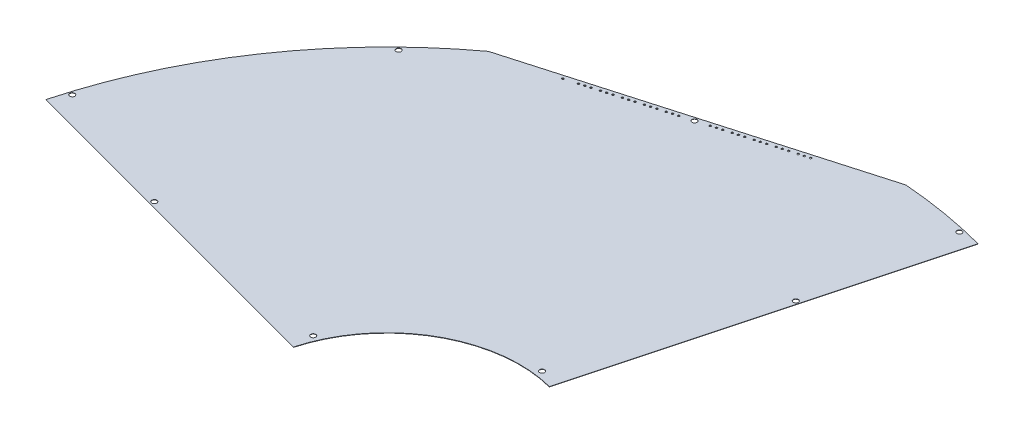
ISO-10303-21;
HEADER;
FILE_DESCRIPTION(('STEP AP214'),'2;1');
FILE_NAME('part.step','',(''),(''),'','','');
FILE_SCHEMA(('AUTOMOTIVE_DESIGN { 1 0 10303 214 1 1 1 1 }'));
ENDSEC;
DATA;
#1=APPLICATION_CONTEXT('core data for automotive mechanical design processes');
#2=APPLICATION_PROTOCOL_DEFINITION('international standard','automotive_design',2000,#1);
#3=PRODUCT_CONTEXT('',#1,'mechanical');
#4=PRODUCT('Part','Part','',(#3));
#5=PRODUCT_RELATED_PRODUCT_CATEGORY('part','',(#4));
#6=PRODUCT_DEFINITION_FORMATION('','',#4);
#7=PRODUCT_DEFINITION_CONTEXT('part definition',#1,'design');
#8=PRODUCT_DEFINITION('design','',#6,#7);
#9=PRODUCT_DEFINITION_SHAPE('','',#8);
#10=(LENGTH_UNIT() NAMED_UNIT(*) SI_UNIT(.MILLI.,.METRE.));
#11=(NAMED_UNIT(*) PLANE_ANGLE_UNIT() SI_UNIT($,.RADIAN.));
#12=(NAMED_UNIT(*) SI_UNIT($,.STERADIAN.) SOLID_ANGLE_UNIT());
#13=UNCERTAINTY_MEASURE_WITH_UNIT(LENGTH_MEASURE(1.E-05),#10,'distance_accuracy_value','');
#14=(GEOMETRIC_REPRESENTATION_CONTEXT(3) GLOBAL_UNCERTAINTY_ASSIGNED_CONTEXT((#13)) GLOBAL_UNIT_ASSIGNED_CONTEXT((#10,
#11,#12)) REPRESENTATION_CONTEXT('',''));
#15=CARTESIAN_POINT('',(0.,0.,0.));
#16=DIRECTION('',(0.,0.,1.));
#17=DIRECTION('',(1.,0.,0.));
#18=AXIS2_PLACEMENT_3D('',#15,#16,#17);
#19=CARTESIAN_POINT('',(0.,0.29,0.));
#20=DIRECTION('',(0.,-1.,0.));
#21=DIRECTION('',(0.,0.,-1.));
#22=AXIS2_PLACEMENT_3D('',#19,#20,#21);
#23=PLANE('',#22);
#24=CARTESIAN_POINT('',(-178.321606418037,0.29,-317.133102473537));
#25=DIRECTION('',(0.,1.,0.));
#26=DIRECTION('',(0.,0.,1.));
#27=AXIS2_PLACEMENT_3D('',#24,#25,#26);
#28=CIRCLE('',#27,0.749999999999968);
#29=CARTESIAN_POINT('',(-178.321606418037,0.29,-316.383102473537));
#30=VERTEX_POINT('',#29);
#31=EDGE_CURVE('E320',#30,#30,#28,.T.);
#32=ORIENTED_EDGE('',*,*,#31,.F.);
#33=EDGE_LOOP('',(#32));
#34=FACE_BOUND('',#33,.T.);
#35=CARTESIAN_POINT('',(-107.188240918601,0.29,-337.530266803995));
#36=DIRECTION('',(0.,1.,0.));
#37=DIRECTION('',(0.,0.,-1.));
#38=AXIS2_PLACEMENT_3D('',#35,#36,#37);
#39=CIRCLE('',#38,0.749999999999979);
#40=CARTESIAN_POINT('',(-107.188240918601,0.29,-338.280266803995));
#41=VERTEX_POINT('',#40);
#42=EDGE_CURVE('E322',#41,#41,#39,.T.);
#43=ORIENTED_EDGE('',*,*,#42,.F.);
#44=EDGE_LOOP('',(#43));
#45=FACE_BOUND('',#44,.T.);
#46=CARTESIAN_POINT('',(-120.645904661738,0.29,-333.671343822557));
#47=DIRECTION('',(0.,1.,0.));
#48=DIRECTION('',(0.,0.,-1.));
#49=AXIS2_PLACEMENT_3D('',#46,#47,#48);
#50=CIRCLE('',#49,0.750000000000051);
#51=CARTESIAN_POINT('',(-120.645904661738,0.29,-334.421343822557));
#52=VERTEX_POINT('',#51);
#53=EDGE_CURVE('E328',#52,#52,#50,.T.);
#54=ORIENTED_EDGE('',*,*,#53,.F.);
#55=EDGE_LOOP('',(#54));
#56=FACE_BOUND('',#55,.T.);
#57=CARTESIAN_POINT('',(-124.490951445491,0.29,-332.568794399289));
#58=DIRECTION('',(0.,1.,0.));
#59=DIRECTION('',(0.,0.,-1.));
#60=AXIS2_PLACEMENT_3D('',#57,#58,#59);
#61=CIRCLE('',#60,0.750000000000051);
#62=CARTESIAN_POINT('',(-124.490951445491,0.29,-333.318794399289));
#63=VERTEX_POINT('',#62);
#64=EDGE_CURVE('E334',#63,#63,#61,.T.);
#65=ORIENTED_EDGE('',*,*,#64,.F.);
#66=EDGE_LOOP('',(#65));
#67=FACE_BOUND('',#66,.T.);
#68=CARTESIAN_POINT('',(-111.033287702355,0.29,-336.427717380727));
#69=DIRECTION('',(0.,1.,0.));
#70=DIRECTION('',(0.,0.,-1.));
#71=AXIS2_PLACEMENT_3D('',#68,#69,#70);
#72=CIRCLE('',#71,0.750000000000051);
#73=CARTESIAN_POINT('',(-111.033287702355,0.29,-337.177717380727));
#74=VERTEX_POINT('',#73);
#75=EDGE_CURVE('E340',#74,#74,#72,.T.);
#76=ORIENTED_EDGE('',*,*,#75,.F.);
#77=EDGE_LOOP('',(#76));
#78=FACE_BOUND('',#77,.T.);
#79=CARTESIAN_POINT('',(-114.878334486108,0.29,-335.325167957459));
#80=DIRECTION('',(0.,1.,0.));
#81=DIRECTION('',(0.,0.,-1.));
#82=AXIS2_PLACEMENT_3D('',#79,#80,#81);
#83=CIRCLE('',#82,0.749999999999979);
#84=CARTESIAN_POINT('',(-114.878334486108,0.29,-336.075167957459));
#85=VERTEX_POINT('',#84);
#86=EDGE_CURVE('E346',#85,#85,#83,.T.);
#87=ORIENTED_EDGE('',*,*,#86,.F.);
#88=EDGE_LOOP('',(#87));
#89=FACE_BOUND('',#88,.T.);
#90=CARTESIAN_POINT('',(-128.335998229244,0.29,-331.466244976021));
#91=DIRECTION('',(0.,1.,0.));
#92=DIRECTION('',(0.,0.,-1.));
#93=AXIS2_PLACEMENT_3D('',#90,#91,#92);
#94=CIRCLE('',#93,0.750000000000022);
#95=CARTESIAN_POINT('',(-128.335998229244,0.29,-332.216244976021));
#96=VERTEX_POINT('',#95);
#97=EDGE_CURVE('E352',#96,#96,#94,.T.);
#98=ORIENTED_EDGE('',*,*,#97,.F.);
#99=EDGE_LOOP('',(#98));
#100=FACE_BOUND('',#99,.T.);
#101=CARTESIAN_POINT('',(-134.103568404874,0.29,-329.812420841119));
#102=DIRECTION('',(0.,1.,0.));
#103=DIRECTION('',(0.,0.,-1.));
#104=AXIS2_PLACEMENT_3D('',#101,#102,#103);
#105=CIRCLE('',#104,0.749999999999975);
#106=CARTESIAN_POINT('',(-134.103568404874,0.29,-330.562420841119));
#107=VERTEX_POINT('',#106);
#108=EDGE_CURVE('E358',#107,#107,#105,.T.);
#109=ORIENTED_EDGE('',*,*,#108,.F.);
#110=EDGE_LOOP('',(#109));
#111=FACE_BOUND('',#110,.T.);
#112=CARTESIAN_POINT('',(-137.948615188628,0.29,-328.709871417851));
#113=DIRECTION('',(0.,1.,0.));
#114=DIRECTION('',(0.,0.,-1.));
#115=AXIS2_PLACEMENT_3D('',#112,#113,#114);
#116=CIRCLE('',#115,0.74999999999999);
#117=CARTESIAN_POINT('',(-137.948615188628,0.29,-329.459871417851));
#118=VERTEX_POINT('',#117);
#119=EDGE_CURVE('E364',#118,#118,#116,.T.);
#120=ORIENTED_EDGE('',*,*,#119,.F.);
#121=EDGE_LOOP('',(#120));
#122=FACE_BOUND('',#121,.T.);
#123=CARTESIAN_POINT('',(-141.793661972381,0.29,-327.607321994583));
#124=DIRECTION('',(0.,1.,0.));
#125=DIRECTION('',(0.,0.,-1.));
#126=AXIS2_PLACEMENT_3D('',#123,#124,#125);
#127=CIRCLE('',#126,0.749999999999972);
#128=CARTESIAN_POINT('',(-141.793661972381,0.29,-328.357321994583));
#129=VERTEX_POINT('',#128);
#130=EDGE_CURVE('E370',#129,#129,#127,.T.);
#131=ORIENTED_EDGE('',*,*,#130,.F.);
#132=EDGE_LOOP('',(#131));
#133=FACE_BOUND('',#132,.T.);
#134=CARTESIAN_POINT('',(-147.561232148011,0.29,-325.953497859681));
#135=DIRECTION('',(0.,1.,0.));
#136=DIRECTION('',(0.,0.,-1.));
#137=AXIS2_PLACEMENT_3D('',#134,#135,#136);
#138=CIRCLE('',#137,0.749999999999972);
#139=CARTESIAN_POINT('',(-147.561232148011,0.29,-326.703497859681));
#140=VERTEX_POINT('',#139);
#141=EDGE_CURVE('E376',#140,#140,#138,.T.);
#142=ORIENTED_EDGE('',*,*,#141,.F.);
#143=EDGE_LOOP('',(#142));
#144=FACE_BOUND('',#143,.T.);
#145=CARTESIAN_POINT('',(-151.406278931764,0.29,-324.850948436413));
#146=DIRECTION('',(0.,1.,0.));
#147=DIRECTION('',(0.,0.,-1.));
#148=AXIS2_PLACEMENT_3D('',#145,#146,#147);
#149=CIRCLE('',#148,0.749999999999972);
#150=CARTESIAN_POINT('',(-151.406278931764,0.29,-325.600948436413));
#151=VERTEX_POINT('',#150);
#152=EDGE_CURVE('E382',#151,#151,#149,.T.);
#153=ORIENTED_EDGE('',*,*,#152,.F.);
#154=EDGE_LOOP('',(#153));
#155=FACE_BOUND('',#154,.T.);
#156=CARTESIAN_POINT('',(-155.251325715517,0.29,-323.748399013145));
#157=DIRECTION('',(0.,1.,0.));
#158=DIRECTION('',(0.,0.,-1.));
#159=AXIS2_PLACEMENT_3D('',#156,#157,#158);
#160=CIRCLE('',#159,0.749999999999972);
#161=CARTESIAN_POINT('',(-155.251325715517,0.29,-324.498399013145));
#162=VERTEX_POINT('',#161);
#163=EDGE_CURVE('E388',#162,#162,#160,.T.);
#164=ORIENTED_EDGE('',*,*,#163,.F.);
#165=EDGE_LOOP('',(#164));
#166=FACE_BOUND('',#165,.T.);
#167=CARTESIAN_POINT('',(-161.018895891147,0.29,-322.094574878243));
#168=DIRECTION('',(0.,1.,0.));
#169=DIRECTION('',(0.,0.,-1.));
#170=AXIS2_PLACEMENT_3D('',#167,#168,#169);
#171=CIRCLE('',#170,0.749999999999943);
#172=CARTESIAN_POINT('',(-161.018895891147,0.29,-322.844574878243));
#173=VERTEX_POINT('',#172);
#174=EDGE_CURVE('E394',#173,#173,#171,.T.);
#175=ORIENTED_EDGE('',*,*,#174,.F.);
#176=EDGE_LOOP('',(#175));
#177=FACE_BOUND('',#176,.T.);
#178=CARTESIAN_POINT('',(-164.863942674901,0.29,-320.992025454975));
#179=DIRECTION('',(0.,1.,0.));
#180=DIRECTION('',(0.,0.,-1.));
#181=AXIS2_PLACEMENT_3D('',#178,#179,#180);
#182=CIRCLE('',#181,0.750000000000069);
#183=CARTESIAN_POINT('',(-164.863942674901,0.29,-321.742025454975));
#184=VERTEX_POINT('',#183);
#185=EDGE_CURVE('E400',#184,#184,#182,.T.);
#186=ORIENTED_EDGE('',*,*,#185,.F.);
#187=EDGE_LOOP('',(#186));
#188=FACE_BOUND('',#187,.T.);
#189=CARTESIAN_POINT('',(-26.4422584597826,0.29,-360.683804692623));
#190=DIRECTION('',(0.,1.,0.));
#191=DIRECTION('',(0.,0.,1.));
#192=AXIS2_PLACEMENT_3D('',#189,#190,#191);
#193=CIRCLE('',#192,0.750000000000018);
#194=CARTESIAN_POINT('',(-26.4422584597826,0.29,-359.933804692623));
#195=VERTEX_POINT('',#194);
#196=EDGE_CURVE('E406',#195,#195,#193,.T.);
#197=ORIENTED_EDGE('',*,*,#196,.F.);
#198=EDGE_LOOP('',(#197));
#199=FACE_BOUND('',#198,.T.);
#200=CARTESIAN_POINT('',(-30.2873052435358,0.29,-359.581255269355));
#201=DIRECTION('',(0.,1.,0.));
#202=DIRECTION('',(0.,0.,1.));
#203=AXIS2_PLACEMENT_3D('',#200,#201,#202);
#204=CIRCLE('',#203,0.750000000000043);
#205=CARTESIAN_POINT('',(-30.2873052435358,0.29,-358.831255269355));
#206=VERTEX_POINT('',#205);
#207=EDGE_CURVE('E412',#206,#206,#204,.T.);
#208=ORIENTED_EDGE('',*,*,#207,.F.);
#209=EDGE_LOOP('',(#208));
#210=FACE_BOUND('',#209,.T.);
#211=CARTESIAN_POINT('',(-34.1323520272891,0.29,-358.478705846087));
#212=DIRECTION('',(0.,1.,0.));
#213=DIRECTION('',(0.,0.,1.));
#214=AXIS2_PLACEMENT_3D('',#211,#212,#213);
#215=CIRCLE('',#214,0.749999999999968);
#216=CARTESIAN_POINT('',(-34.1323520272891,0.29,-357.728705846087));
#217=VERTEX_POINT('',#216);
#218=EDGE_CURVE('E418',#217,#217,#215,.T.);
#219=ORIENTED_EDGE('',*,*,#218,.F.);
#220=EDGE_LOOP('',(#219));
#221=FACE_BOUND('',#220,.T.);
#222=CARTESIAN_POINT('',(-39.899922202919,0.29,-356.824881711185));
#223=DIRECTION('',(0.,1.,0.));
#224=DIRECTION('',(0.,0.,1.));
#225=AXIS2_PLACEMENT_3D('',#222,#223,#224);
#226=CIRCLE('',#225,0.749999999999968);
#227=CARTESIAN_POINT('',(-39.899922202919,0.29,-356.074881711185));
#228=VERTEX_POINT('',#227);
#229=EDGE_CURVE('E424',#228,#228,#226,.T.);
#230=ORIENTED_EDGE('',*,*,#229,.F.);
#231=EDGE_LOOP('',(#230));
#232=FACE_BOUND('',#231,.T.);
#233=CARTESIAN_POINT('',(-43.7449689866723,0.29,-355.722332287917));
#234=DIRECTION('',(0.,1.,0.));
#235=DIRECTION('',(0.,0.,1.));
#236=AXIS2_PLACEMENT_3D('',#233,#234,#235);
#237=CIRCLE('',#236,0.749999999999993);
#238=CARTESIAN_POINT('',(-43.7449689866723,0.29,-354.972332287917));
#239=VERTEX_POINT('',#238);
#240=EDGE_CURVE('E430',#239,#239,#237,.T.);
#241=ORIENTED_EDGE('',*,*,#240,.F.);
#242=EDGE_LOOP('',(#241));
#243=FACE_BOUND('',#242,.T.);
#244=CARTESIAN_POINT('',(-47.5900157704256,0.29,-354.619782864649));
#245=DIRECTION('',(0.,1.,0.));
#246=DIRECTION('',(0.,0.,1.));
#247=AXIS2_PLACEMENT_3D('',#244,#245,#246);
#248=CIRCLE('',#247,0.749999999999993);
#249=CARTESIAN_POINT('',(-47.5900157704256,0.29,-353.869782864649));
#250=VERTEX_POINT('',#249);
#251=EDGE_CURVE('E436',#250,#250,#248,.T.);
#252=ORIENTED_EDGE('',*,*,#251,.F.);
#253=EDGE_LOOP('',(#252));
#254=FACE_BOUND('',#253,.T.);
#255=CARTESIAN_POINT('',(-53.3575859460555,0.29,-352.965958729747));
#256=DIRECTION('',(0.,1.,0.));
#257=DIRECTION('',(0.,0.,1.));
#258=AXIS2_PLACEMENT_3D('',#255,#256,#257);
#259=CIRCLE('',#258,0.749999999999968);
#260=CARTESIAN_POINT('',(-53.3575859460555,0.29,-352.215958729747));
#261=VERTEX_POINT('',#260);
#262=EDGE_CURVE('E442',#261,#261,#259,.T.);
#263=ORIENTED_EDGE('',*,*,#262,.F.);
#264=EDGE_LOOP('',(#263));
#265=FACE_BOUND('',#264,.T.);
#266=CARTESIAN_POINT('',(-57.2026327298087,0.29,-351.863409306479));
#267=DIRECTION('',(0.,1.,0.));
#268=DIRECTION('',(0.,0.,1.));
#269=AXIS2_PLACEMENT_3D('',#266,#267,#268);
#270=CIRCLE('',#269,0.750000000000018);
#271=CARTESIAN_POINT('',(-57.2026327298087,0.29,-351.113409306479));
#272=VERTEX_POINT('',#271);
#273=EDGE_CURVE('E448',#272,#272,#270,.T.);
#274=ORIENTED_EDGE('',*,*,#273,.F.);
#275=EDGE_LOOP('',(#274));
#276=FACE_BOUND('',#275,.T.);
#277=CARTESIAN_POINT('',(-61.047679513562,0.29,-350.760859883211));
#278=DIRECTION('',(0.,1.,0.));
#279=DIRECTION('',(0.,0.,1.));
#280=AXIS2_PLACEMENT_3D('',#277,#278,#279);
#281=CIRCLE('',#280,0.749999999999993);
#282=CARTESIAN_POINT('',(-61.047679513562,0.29,-350.010859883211));
#283=VERTEX_POINT('',#282);
#284=EDGE_CURVE('E454',#283,#283,#281,.T.);
#285=ORIENTED_EDGE('',*,*,#284,.F.);
#286=EDGE_LOOP('',(#285));
#287=FACE_BOUND('',#286,.T.);
#288=CARTESIAN_POINT('',(-66.8152496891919,0.29,-349.107035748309));
#289=DIRECTION('',(0.,1.,0.));
#290=DIRECTION('',(0.,0.,1.));
#291=AXIS2_PLACEMENT_3D('',#288,#289,#290);
#292=CIRCLE('',#291,0.749999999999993);
#293=CARTESIAN_POINT('',(-66.8152496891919,0.29,-348.357035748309));
#294=VERTEX_POINT('',#293);
#295=EDGE_CURVE('E460',#294,#294,#292,.T.);
#296=ORIENTED_EDGE('',*,*,#295,.F.);
#297=EDGE_LOOP('',(#296));
#298=FACE_BOUND('',#297,.T.);
#299=CARTESIAN_POINT('',(-80.2729134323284,0.29,-345.248112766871));
#300=DIRECTION('',(0.,1.,0.));
#301=DIRECTION('',(0.,0.,1.));
#302=AXIS2_PLACEMENT_3D('',#299,#300,#301);
#303=CIRCLE('',#302,0.749999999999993);
#304=CARTESIAN_POINT('',(-80.2729134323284,0.29,-344.498112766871));
#305=VERTEX_POINT('',#304);
#306=EDGE_CURVE('E466',#305,#305,#303,.T.);
#307=ORIENTED_EDGE('',*,*,#306,.F.);
#308=EDGE_LOOP('',(#307));
#309=FACE_BOUND('',#308,.T.);
#310=CARTESIAN_POINT('',(-84.1179602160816,0.29,-344.145563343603));
#311=DIRECTION('',(0.,1.,0.));
#312=DIRECTION('',(0.,0.,1.));
#313=AXIS2_PLACEMENT_3D('',#310,#311,#312);
#314=CIRCLE('',#313,0.750000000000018);
#315=CARTESIAN_POINT('',(-84.1179602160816,0.29,-343.395563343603));
#316=VERTEX_POINT('',#315);
#317=EDGE_CURVE('E472',#316,#316,#314,.T.);
#318=ORIENTED_EDGE('',*,*,#317,.F.);
#319=EDGE_LOOP('',(#318));
#320=FACE_BOUND('',#319,.T.);
#321=CARTESIAN_POINT('',(-70.6602964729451,0.29,-348.004486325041));
#322=DIRECTION('',(0.,1.,0.));
#323=DIRECTION('',(0.,0.,1.));
#324=AXIS2_PLACEMENT_3D('',#321,#322,#323);
#325=CIRCLE('',#324,0.749999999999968);
#326=CARTESIAN_POINT('',(-70.6602964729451,0.29,-347.254486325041));
#327=VERTEX_POINT('',#326);
#328=EDGE_CURVE('E478',#327,#327,#325,.T.);
#329=ORIENTED_EDGE('',*,*,#328,.F.);
#330=EDGE_LOOP('',(#329));
#331=FACE_BOUND('',#330,.T.);
#332=CARTESIAN_POINT('',(-74.5053432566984,0.29,-346.901936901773));
#333=DIRECTION('',(0.,1.,0.));
#334=DIRECTION('',(0.,0.,1.));
#335=AXIS2_PLACEMENT_3D('',#332,#333,#334);
#336=CIRCLE('',#335,0.749999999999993);
#337=CARTESIAN_POINT('',(-74.5053432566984,0.29,-346.151936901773));
#338=VERTEX_POINT('',#337);
#339=EDGE_CURVE('E484',#338,#338,#336,.T.);
#340=ORIENTED_EDGE('',*,*,#339,.F.);
#341=EDGE_LOOP('',(#340));
#342=FACE_BOUND('',#341,.T.);
#343=CARTESIAN_POINT('',(-168.708989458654,0.29,-319.889476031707));
#344=DIRECTION('',(0.,1.,0.));
#345=DIRECTION('',(0.,0.,-1.));
#346=AXIS2_PLACEMENT_3D('',#343,#344,#345);
#347=CIRCLE('',#346,0.750000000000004);
#348=CARTESIAN_POINT('',(-168.708989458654,0.29,-320.639476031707));
#349=VERTEX_POINT('',#348);
#350=EDGE_CURVE('E490',#349,#349,#347,.T.);
#351=ORIENTED_EDGE('',*,*,#350,.F.);
#352=EDGE_LOOP('',(#351));
#353=FACE_BOUND('',#352,.T.);
#354=CARTESIAN_POINT('',(-87.9630069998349,0.29,-343.043013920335));
#355=DIRECTION('',(0.,1.,0.));
#356=DIRECTION('',(0.,0.,1.));
#357=AXIS2_PLACEMENT_3D('',#354,#355,#356);
#358=CIRCLE('',#357,0.750000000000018);
#359=CARTESIAN_POINT('',(-87.9630069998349,0.29,-342.293013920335));
#360=VERTEX_POINT('',#359);
#361=EDGE_CURVE('E496',#360,#360,#358,.T.);
#362=ORIENTED_EDGE('',*,*,#361,.F.);
#363=EDGE_LOOP('',(#362));
#364=FACE_BOUND('',#363,.T.);
#365=CARTESIAN_POINT('',(65.3116260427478,0.29,-257.26926828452));
#366=DIRECTION('',(0.,1.,0.));
#367=DIRECTION('',(0.,0.,1.));
#368=AXIS2_PLACEMENT_3D('',#365,#366,#367);
#369=CIRCLE('',#368,2.);
#370=CARTESIAN_POINT('',(65.3116260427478,0.29,-255.26926828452));
#371=VERTEX_POINT('',#370);
#372=EDGE_CURVE('E511',#371,#371,#369,.T.);
#373=ORIENTED_EDGE('',*,*,#372,.F.);
#374=EDGE_LOOP('',(#373));
#375=FACE_BOUND('',#374,.T.);
#376=CARTESIAN_POINT('',(13.2141853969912,0.29,-109.203412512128));
#377=DIRECTION('',(0.,1.,0.));
#378=DIRECTION('',(0.,0.,1.));
#379=AXIS2_PLACEMENT_3D('',#376,#377,#378);
#380=CIRCLE('',#379,2.);
#381=CARTESIAN_POINT('',(13.2141853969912,0.29,-107.203412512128));
#382=VERTEX_POINT('',#381);
#383=EDGE_CURVE('E523',#382,#382,#380,.T.);
#384=ORIENTED_EDGE('',*,*,#383,.F.);
#385=EDGE_LOOP('',(#384));
#386=FACE_BOUND('',#385,.T.);
#387=CARTESIAN_POINT('',(-101.18002211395,0.29,-43.1578860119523));
#388=DIRECTION('',(0.,1.,0.));
#389=DIRECTION('',(0.,0.,1.));
#390=AXIS2_PLACEMENT_3D('',#387,#388,#389);
#391=CIRCLE('',#390,2.);
#392=CARTESIAN_POINT('',(-101.18002211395,0.29,-41.1578860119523));
#393=VERTEX_POINT('',#392);
#394=EDGE_CURVE('E535',#393,#393,#391,.T.);
#395=ORIENTED_EDGE('',*,*,#394,.F.);
#396=EDGE_LOOP('',(#395));
#397=FACE_BOUND('',#396,.T.);
#398=CARTESIAN_POINT('',(-360.801175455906,0.29,-112.723164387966));
#399=DIRECTION('',(0.,1.,0.));
#400=DIRECTION('',(0.,0.,1.));
#401=AXIS2_PLACEMENT_3D('',#398,#399,#400);
#402=CIRCLE('',#401,2.);
#403=CARTESIAN_POINT('',(-360.801175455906,0.29,-110.723164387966));
#404=VERTEX_POINT('',#403);
#405=EDGE_CURVE('E119',#404,#404,#402,.T.);
#406=ORIENTED_EDGE('',*,*,#405,.F.);
#407=EDGE_LOOP('',(#406));
#408=FACE_BOUND('',#407,.T.);
#409=CARTESIAN_POINT('',(0.,0.29,0.));
#410=DIRECTION('',(0.,1.,0.));
#411=DIRECTION('',(0.,0.,-1.));
#412=AXIS2_PLACEMENT_3D('',#409,#410,#411);
#413=CIRCLE('',#412,381.);
#414=CARTESIAN_POINT('',(98.1270083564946,0.29,-368.146832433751));
#415=VERTEX_POINT('',#414);
#416=CARTESIAN_POINT('',(29.5283591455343,0.29,-379.854019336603));
#417=VERTEX_POINT('',#416);
#418=EDGE_CURVE('E126',#415,#417,#413,.T.);
#419=ORIENTED_EDGE('',*,*,#418,.T.);
#420=DIRECTION('',(-0.961261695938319,0.,0.275637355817));
#421=VECTOR('',#420,1.);
#422=CARTESIAN_POINT('',(29.5283591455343,0.29,-379.854019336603));
#423=LINE('',#422,#421);
#424=CARTESIAN_POINT('',(-226.333431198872,0.29,-306.486831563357));
#425=VERTEX_POINT('',#424);
#426=EDGE_CURVE('E84',#417,#425,#423,.T.);
#427=ORIENTED_EDGE('',*,*,#426,.T.);
#428=CARTESIAN_POINT('',(0.,0.29,0.));
#429=DIRECTION('',(0.,1.,0.));
#430=DIRECTION('',(0.,0.,-1.));
#431=AXIS2_PLACEMENT_3D('',#428,#429,#430);
#432=CIRCLE('',#431,381.);
#433=CARTESIAN_POINT('',(-367.888013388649,0.29,-99.0929341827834));
#434=VERTEX_POINT('',#433);
#435=EDGE_CURVE('E97',#425,#434,#432,.T.);
#436=ORIENTED_EDGE('',*,*,#435,.T.);
#437=DIRECTION('',(0.965925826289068,0.,0.258819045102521));
#438=VECTOR('',#437,1.);
#439=CARTESIAN_POINT('',(-101.291652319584,0.29,-27.6586545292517));
#440=LINE('',#439,#438);
#441=CARTESIAN_POINT('',(-101.291652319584,0.29,-27.6586545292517));
#442=VERTEX_POINT('',#441);
#443=EDGE_CURVE('E91',#434,#442,#440,.T.);
#444=ORIENTED_EDGE('',*,*,#443,.T.);
#445=CARTESIAN_POINT('',(0.,0.29,0.));
#446=DIRECTION('',(0.,-1.,0.));
#447=DIRECTION('',(0.,0.,-1.));
#448=AXIS2_PLACEMENT_3D('',#445,#446,#447);
#449=CIRCLE('',#448,105.);
#450=CARTESIAN_POINT('',(26.6927287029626,0.29,-101.550471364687));
#451=VERTEX_POINT('',#450);
#452=EDGE_CURVE('E95',#442,#451,#449,.T.);
#453=ORIENTED_EDGE('',*,*,#452,.T.);
#454=DIRECTION('',(0.258819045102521,0.,-0.965925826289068));
#455=VECTOR('',#454,1.);
#456=CARTESIAN_POINT('',(26.6927287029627,0.29,-101.550471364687));
#457=LINE('',#456,#455);
#458=EDGE_CURVE('E47',#451,#415,#457,.T.);
#459=ORIENTED_EDGE('',*,*,#458,.T.);
#460=EDGE_LOOP('',(#419,#427,#436,#444,#453,#459));
#461=FACE_BOUND('',#460,.T.);
#462=CARTESIAN_POINT('',(-262.5808640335,0.29,-271.910444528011));
#463=DIRECTION('',(0.,1.,0.));
#464=DIRECTION('',(0.,0.,1.));
#465=AXIS2_PLACEMENT_3D('',#462,#463,#464);
#466=CIRCLE('',#465,2.);
#467=CARTESIAN_POINT('',(-262.5808640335,0.29,-269.910444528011));
#468=VERTEX_POINT('',#467);
#469=EDGE_CURVE('E541',#468,#468,#466,.T.);
#470=ORIENTED_EDGE('',*,*,#469,.F.);
#471=EDGE_LOOP('',(#470));
#472=FACE_BOUND('',#471,.T.);
#473=CARTESIAN_POINT('',(-97.5756239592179,0.29,-340.286640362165));
#474=DIRECTION('',(0.,1.,0.));
#475=DIRECTION('',(0.,0.,1.));
#476=AXIS2_PLACEMENT_3D('',#473,#474,#475);
#477=CIRCLE('',#476,2.);
#478=CARTESIAN_POINT('',(-97.5756239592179,0.29,-338.286640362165));
#479=VERTEX_POINT('',#478);
#480=EDGE_CURVE('E529',#479,#479,#477,.T.);
#481=ORIENTED_EDGE('',*,*,#480,.F.);
#482=EDGE_LOOP('',(#481));
#483=FACE_BOUND('',#482,.T.);
#484=CARTESIAN_POINT('',(82.7794637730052,0.29,-368.824565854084));
#485=DIRECTION('',(0.,1.,0.));
#486=DIRECTION('',(0.,0.,1.));
#487=AXIS2_PLACEMENT_3D('',#484,#485,#486);
#488=CIRCLE('',#487,1.99999999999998);
#489=CARTESIAN_POINT('',(82.7794637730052,0.29,-366.824565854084));
#490=VERTEX_POINT('',#489);
#491=EDGE_CURVE('E517',#490,#490,#488,.T.);
#492=ORIENTED_EDGE('',*,*,#491,.F.);
#493=EDGE_LOOP('',(#492));
#494=FACE_BOUND('',#493,.T.);
#495=CARTESIAN_POINT('',(-255.457534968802,0.29,-72.0731068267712));
#496=DIRECTION('',(0.,1.,0.));
#497=DIRECTION('',(0.,0.,1.));
#498=AXIS2_PLACEMENT_3D('',#495,#496,#497);
#499=CIRCLE('',#498,2.);
#500=CARTESIAN_POINT('',(-255.457534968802,0.29,-70.0731068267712));
#501=VERTEX_POINT('',#500);
#502=EDGE_CURVE('E505',#501,#501,#499,.T.);
#503=ORIENTED_EDGE('',*,*,#502,.F.);
#504=EDGE_LOOP('',(#503));
#505=FACE_BOUND('',#504,.T.);
#506=ADVANCED_FACE('F30',(#34,#45,#56,#67,#78,#89,#100,#111,#122,#133,#144,#155,#166,#177,#188,
#199,#210,#221,#232,#243,#254,#265,#276,#287,#298,#309,#320,#331,#342,#353,#364,#375,#386,#397,
#408,#461,#472,#483,#494,#505),#23,.F.);
#507=CARTESIAN_POINT('',(0.,0.,0.));
#508=DIRECTION('',(0.,-1.,0.));
#509=DIRECTION('',(0.,0.,-1.));
#510=AXIS2_PLACEMENT_3D('',#507,#508,#509);
#511=PLANE('',#510);
#512=CARTESIAN_POINT('',(-178.321606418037,0.,-317.133102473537));
#513=DIRECTION('',(0.,1.,0.));
#514=DIRECTION('',(0.,0.,1.));
#515=AXIS2_PLACEMENT_3D('',#512,#513,#514);
#516=CIRCLE('',#515,0.749999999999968);
#517=CARTESIAN_POINT('',(-178.321606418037,0.,-316.383102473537));
#518=VERTEX_POINT('',#517);
#519=EDGE_CURVE('E318',#518,#518,#516,.T.);
#520=ORIENTED_EDGE('',*,*,#519,.T.);
#521=EDGE_LOOP('',(#520));
#522=FACE_BOUND('',#521,.T.);
#523=CARTESIAN_POINT('',(-107.188240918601,0.,-337.530266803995));
#524=DIRECTION('',(0.,1.,0.));
#525=DIRECTION('',(0.,0.,-1.));
#526=AXIS2_PLACEMENT_3D('',#523,#524,#525);
#527=CIRCLE('',#526,0.749999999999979);
#528=CARTESIAN_POINT('',(-107.188240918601,0.,-338.280266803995));
#529=VERTEX_POINT('',#528);
#530=EDGE_CURVE('E325',#529,#529,#527,.T.);
#531=ORIENTED_EDGE('',*,*,#530,.T.);
#532=EDGE_LOOP('',(#531));
#533=FACE_BOUND('',#532,.T.);
#534=CARTESIAN_POINT('',(-120.645904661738,0.,-333.671343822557));
#535=DIRECTION('',(0.,1.,0.));
#536=DIRECTION('',(0.,0.,-1.));
#537=AXIS2_PLACEMENT_3D('',#534,#535,#536);
#538=CIRCLE('',#537,0.750000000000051);
#539=CARTESIAN_POINT('',(-120.645904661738,0.,-334.421343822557));
#540=VERTEX_POINT('',#539);
#541=EDGE_CURVE('E331',#540,#540,#538,.T.);
#542=ORIENTED_EDGE('',*,*,#541,.T.);
#543=EDGE_LOOP('',(#542));
#544=FACE_BOUND('',#543,.T.);
#545=CARTESIAN_POINT('',(-124.490951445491,0.,-332.568794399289));
#546=DIRECTION('',(0.,1.,0.));
#547=DIRECTION('',(0.,0.,-1.));
#548=AXIS2_PLACEMENT_3D('',#545,#546,#547);
#549=CIRCLE('',#548,0.750000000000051);
#550=CARTESIAN_POINT('',(-124.490951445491,0.,-333.318794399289));
#551=VERTEX_POINT('',#550);
#552=EDGE_CURVE('E337',#551,#551,#549,.T.);
#553=ORIENTED_EDGE('',*,*,#552,.T.);
#554=EDGE_LOOP('',(#553));
#555=FACE_BOUND('',#554,.T.);
#556=CARTESIAN_POINT('',(-111.033287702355,0.,-336.427717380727));
#557=DIRECTION('',(0.,1.,0.));
#558=DIRECTION('',(0.,0.,-1.));
#559=AXIS2_PLACEMENT_3D('',#556,#557,#558);
#560=CIRCLE('',#559,0.750000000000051);
#561=CARTESIAN_POINT('',(-111.033287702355,0.,-337.177717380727));
#562=VERTEX_POINT('',#561);
#563=EDGE_CURVE('E343',#562,#562,#560,.T.);
#564=ORIENTED_EDGE('',*,*,#563,.T.);
#565=EDGE_LOOP('',(#564));
#566=FACE_BOUND('',#565,.T.);
#567=CARTESIAN_POINT('',(-114.878334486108,0.,-335.325167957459));
#568=DIRECTION('',(0.,1.,0.));
#569=DIRECTION('',(0.,0.,-1.));
#570=AXIS2_PLACEMENT_3D('',#567,#568,#569);
#571=CIRCLE('',#570,0.749999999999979);
#572=CARTESIAN_POINT('',(-114.878334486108,0.,-336.075167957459));
#573=VERTEX_POINT('',#572);
#574=EDGE_CURVE('E349',#573,#573,#571,.T.);
#575=ORIENTED_EDGE('',*,*,#574,.T.);
#576=EDGE_LOOP('',(#575));
#577=FACE_BOUND('',#576,.T.);
#578=CARTESIAN_POINT('',(-128.335998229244,0.,-331.466244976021));
#579=DIRECTION('',(0.,1.,0.));
#580=DIRECTION('',(0.,0.,-1.));
#581=AXIS2_PLACEMENT_3D('',#578,#579,#580);
#582=CIRCLE('',#581,0.750000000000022);
#583=CARTESIAN_POINT('',(-128.335998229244,0.,-332.216244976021));
#584=VERTEX_POINT('',#583);
#585=EDGE_CURVE('E355',#584,#584,#582,.T.);
#586=ORIENTED_EDGE('',*,*,#585,.T.);
#587=EDGE_LOOP('',(#586));
#588=FACE_BOUND('',#587,.T.);
#589=CARTESIAN_POINT('',(-134.103568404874,0.,-329.812420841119));
#590=DIRECTION('',(0.,1.,0.));
#591=DIRECTION('',(0.,0.,-1.));
#592=AXIS2_PLACEMENT_3D('',#589,#590,#591);
#593=CIRCLE('',#592,0.749999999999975);
#594=CARTESIAN_POINT('',(-134.103568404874,0.,-330.562420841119));
#595=VERTEX_POINT('',#594);
#596=EDGE_CURVE('E361',#595,#595,#593,.T.);
#597=ORIENTED_EDGE('',*,*,#596,.T.);
#598=EDGE_LOOP('',(#597));
#599=FACE_BOUND('',#598,.T.);
#600=CARTESIAN_POINT('',(-137.948615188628,0.,-328.709871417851));
#601=DIRECTION('',(0.,1.,0.));
#602=DIRECTION('',(0.,0.,-1.));
#603=AXIS2_PLACEMENT_3D('',#600,#601,#602);
#604=CIRCLE('',#603,0.74999999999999);
#605=CARTESIAN_POINT('',(-137.948615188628,0.,-329.459871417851));
#606=VERTEX_POINT('',#605);
#607=EDGE_CURVE('E367',#606,#606,#604,.T.);
#608=ORIENTED_EDGE('',*,*,#607,.T.);
#609=EDGE_LOOP('',(#608));
#610=FACE_BOUND('',#609,.T.);
#611=CARTESIAN_POINT('',(-141.793661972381,0.,-327.607321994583));
#612=DIRECTION('',(0.,1.,0.));
#613=DIRECTION('',(0.,0.,-1.));
#614=AXIS2_PLACEMENT_3D('',#611,#612,#613);
#615=CIRCLE('',#614,0.749999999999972);
#616=CARTESIAN_POINT('',(-141.793661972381,0.,-328.357321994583));
#617=VERTEX_POINT('',#616);
#618=EDGE_CURVE('E373',#617,#617,#615,.T.);
#619=ORIENTED_EDGE('',*,*,#618,.T.);
#620=EDGE_LOOP('',(#619));
#621=FACE_BOUND('',#620,.T.);
#622=CARTESIAN_POINT('',(-147.561232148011,0.,-325.953497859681));
#623=DIRECTION('',(0.,1.,0.));
#624=DIRECTION('',(0.,0.,-1.));
#625=AXIS2_PLACEMENT_3D('',#622,#623,#624);
#626=CIRCLE('',#625,0.749999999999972);
#627=CARTESIAN_POINT('',(-147.561232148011,0.,-326.703497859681));
#628=VERTEX_POINT('',#627);
#629=EDGE_CURVE('E379',#628,#628,#626,.T.);
#630=ORIENTED_EDGE('',*,*,#629,.T.);
#631=EDGE_LOOP('',(#630));
#632=FACE_BOUND('',#631,.T.);
#633=CARTESIAN_POINT('',(-151.406278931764,0.,-324.850948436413));
#634=DIRECTION('',(0.,1.,0.));
#635=DIRECTION('',(0.,0.,-1.));
#636=AXIS2_PLACEMENT_3D('',#633,#634,#635);
#637=CIRCLE('',#636,0.749999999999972);
#638=CARTESIAN_POINT('',(-151.406278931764,0.,-325.600948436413));
#639=VERTEX_POINT('',#638);
#640=EDGE_CURVE('E385',#639,#639,#637,.T.);
#641=ORIENTED_EDGE('',*,*,#640,.T.);
#642=EDGE_LOOP('',(#641));
#643=FACE_BOUND('',#642,.T.);
#644=CARTESIAN_POINT('',(-155.251325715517,0.,-323.748399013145));
#645=DIRECTION('',(0.,1.,0.));
#646=DIRECTION('',(0.,0.,-1.));
#647=AXIS2_PLACEMENT_3D('',#644,#645,#646);
#648=CIRCLE('',#647,0.749999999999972);
#649=CARTESIAN_POINT('',(-155.251325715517,0.,-324.498399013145));
#650=VERTEX_POINT('',#649);
#651=EDGE_CURVE('E391',#650,#650,#648,.T.);
#652=ORIENTED_EDGE('',*,*,#651,.T.);
#653=EDGE_LOOP('',(#652));
#654=FACE_BOUND('',#653,.T.);
#655=CARTESIAN_POINT('',(-161.018895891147,0.,-322.094574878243));
#656=DIRECTION('',(0.,1.,0.));
#657=DIRECTION('',(0.,0.,-1.));
#658=AXIS2_PLACEMENT_3D('',#655,#656,#657);
#659=CIRCLE('',#658,0.749999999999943);
#660=CARTESIAN_POINT('',(-161.018895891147,0.,-322.844574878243));
#661=VERTEX_POINT('',#660);
#662=EDGE_CURVE('E397',#661,#661,#659,.T.);
#663=ORIENTED_EDGE('',*,*,#662,.T.);
#664=EDGE_LOOP('',(#663));
#665=FACE_BOUND('',#664,.T.);
#666=CARTESIAN_POINT('',(-164.863942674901,0.,-320.992025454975));
#667=DIRECTION('',(0.,1.,0.));
#668=DIRECTION('',(0.,0.,-1.));
#669=AXIS2_PLACEMENT_3D('',#666,#667,#668);
#670=CIRCLE('',#669,0.750000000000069);
#671=CARTESIAN_POINT('',(-164.863942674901,0.,-321.742025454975));
#672=VERTEX_POINT('',#671);
#673=EDGE_CURVE('E403',#672,#672,#670,.T.);
#674=ORIENTED_EDGE('',*,*,#673,.T.);
#675=EDGE_LOOP('',(#674));
#676=FACE_BOUND('',#675,.T.);
#677=CARTESIAN_POINT('',(-26.4422584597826,0.,-360.683804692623));
#678=DIRECTION('',(0.,1.,0.));
#679=DIRECTION('',(0.,0.,1.));
#680=AXIS2_PLACEMENT_3D('',#677,#678,#679);
#681=CIRCLE('',#680,0.750000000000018);
#682=CARTESIAN_POINT('',(-26.4422584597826,0.,-359.933804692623));
#683=VERTEX_POINT('',#682);
#684=EDGE_CURVE('E409',#683,#683,#681,.T.);
#685=ORIENTED_EDGE('',*,*,#684,.T.);
#686=EDGE_LOOP('',(#685));
#687=FACE_BOUND('',#686,.T.);
#688=CARTESIAN_POINT('',(-30.2873052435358,0.,-359.581255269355));
#689=DIRECTION('',(0.,1.,0.));
#690=DIRECTION('',(0.,0.,1.));
#691=AXIS2_PLACEMENT_3D('',#688,#689,#690);
#692=CIRCLE('',#691,0.750000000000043);
#693=CARTESIAN_POINT('',(-30.2873052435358,0.,-358.831255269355));
#694=VERTEX_POINT('',#693);
#695=EDGE_CURVE('E415',#694,#694,#692,.T.);
#696=ORIENTED_EDGE('',*,*,#695,.T.);
#697=EDGE_LOOP('',(#696));
#698=FACE_BOUND('',#697,.T.);
#699=CARTESIAN_POINT('',(-34.1323520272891,0.,-358.478705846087));
#700=DIRECTION('',(0.,1.,0.));
#701=DIRECTION('',(0.,0.,1.));
#702=AXIS2_PLACEMENT_3D('',#699,#700,#701);
#703=CIRCLE('',#702,0.749999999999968);
#704=CARTESIAN_POINT('',(-34.1323520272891,0.,-357.728705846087));
#705=VERTEX_POINT('',#704);
#706=EDGE_CURVE('E421',#705,#705,#703,.T.);
#707=ORIENTED_EDGE('',*,*,#706,.T.);
#708=EDGE_LOOP('',(#707));
#709=FACE_BOUND('',#708,.T.);
#710=CARTESIAN_POINT('',(-39.899922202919,0.,-356.824881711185));
#711=DIRECTION('',(0.,1.,0.));
#712=DIRECTION('',(0.,0.,1.));
#713=AXIS2_PLACEMENT_3D('',#710,#711,#712);
#714=CIRCLE('',#713,0.749999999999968);
#715=CARTESIAN_POINT('',(-39.899922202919,0.,-356.074881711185));
#716=VERTEX_POINT('',#715);
#717=EDGE_CURVE('E427',#716,#716,#714,.T.);
#718=ORIENTED_EDGE('',*,*,#717,.T.);
#719=EDGE_LOOP('',(#718));
#720=FACE_BOUND('',#719,.T.);
#721=CARTESIAN_POINT('',(-43.7449689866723,0.,-355.722332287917));
#722=DIRECTION('',(0.,1.,0.));
#723=DIRECTION('',(0.,0.,1.));
#724=AXIS2_PLACEMENT_3D('',#721,#722,#723);
#725=CIRCLE('',#724,0.749999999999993);
#726=CARTESIAN_POINT('',(-43.7449689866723,0.,-354.972332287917));
#727=VERTEX_POINT('',#726);
#728=EDGE_CURVE('E433',#727,#727,#725,.T.);
#729=ORIENTED_EDGE('',*,*,#728,.T.);
#730=EDGE_LOOP('',(#729));
#731=FACE_BOUND('',#730,.T.);
#732=CARTESIAN_POINT('',(-47.5900157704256,0.,-354.619782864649));
#733=DIRECTION('',(0.,1.,0.));
#734=DIRECTION('',(0.,0.,1.));
#735=AXIS2_PLACEMENT_3D('',#732,#733,#734);
#736=CIRCLE('',#735,0.749999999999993);
#737=CARTESIAN_POINT('',(-47.5900157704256,0.,-353.869782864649));
#738=VERTEX_POINT('',#737);
#739=EDGE_CURVE('E439',#738,#738,#736,.T.);
#740=ORIENTED_EDGE('',*,*,#739,.T.);
#741=EDGE_LOOP('',(#740));
#742=FACE_BOUND('',#741,.T.);
#743=CARTESIAN_POINT('',(-53.3575859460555,0.,-352.965958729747));
#744=DIRECTION('',(0.,1.,0.));
#745=DIRECTION('',(0.,0.,1.));
#746=AXIS2_PLACEMENT_3D('',#743,#744,#745);
#747=CIRCLE('',#746,0.749999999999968);
#748=CARTESIAN_POINT('',(-53.3575859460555,0.,-352.215958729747));
#749=VERTEX_POINT('',#748);
#750=EDGE_CURVE('E445',#749,#749,#747,.T.);
#751=ORIENTED_EDGE('',*,*,#750,.T.);
#752=EDGE_LOOP('',(#751));
#753=FACE_BOUND('',#752,.T.);
#754=CARTESIAN_POINT('',(-57.2026327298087,0.,-351.863409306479));
#755=DIRECTION('',(0.,1.,0.));
#756=DIRECTION('',(0.,0.,1.));
#757=AXIS2_PLACEMENT_3D('',#754,#755,#756);
#758=CIRCLE('',#757,0.750000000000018);
#759=CARTESIAN_POINT('',(-57.2026327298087,0.,-351.113409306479));
#760=VERTEX_POINT('',#759);
#761=EDGE_CURVE('E451',#760,#760,#758,.T.);
#762=ORIENTED_EDGE('',*,*,#761,.T.);
#763=EDGE_LOOP('',(#762));
#764=FACE_BOUND('',#763,.T.);
#765=CARTESIAN_POINT('',(-61.047679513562,0.,-350.760859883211));
#766=DIRECTION('',(0.,1.,0.));
#767=DIRECTION('',(0.,0.,1.));
#768=AXIS2_PLACEMENT_3D('',#765,#766,#767);
#769=CIRCLE('',#768,0.749999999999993);
#770=CARTESIAN_POINT('',(-61.047679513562,0.,-350.010859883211));
#771=VERTEX_POINT('',#770);
#772=EDGE_CURVE('E457',#771,#771,#769,.T.);
#773=ORIENTED_EDGE('',*,*,#772,.T.);
#774=EDGE_LOOP('',(#773));
#775=FACE_BOUND('',#774,.T.);
#776=CARTESIAN_POINT('',(-66.8152496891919,0.,-349.107035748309));
#777=DIRECTION('',(0.,1.,0.));
#778=DIRECTION('',(0.,0.,1.));
#779=AXIS2_PLACEMENT_3D('',#776,#777,#778);
#780=CIRCLE('',#779,0.749999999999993);
#781=CARTESIAN_POINT('',(-66.8152496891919,0.,-348.357035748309));
#782=VERTEX_POINT('',#781);
#783=EDGE_CURVE('E463',#782,#782,#780,.T.);
#784=ORIENTED_EDGE('',*,*,#783,.T.);
#785=EDGE_LOOP('',(#784));
#786=FACE_BOUND('',#785,.T.);
#787=CARTESIAN_POINT('',(-80.2729134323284,0.,-345.248112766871));
#788=DIRECTION('',(0.,1.,0.));
#789=DIRECTION('',(0.,0.,1.));
#790=AXIS2_PLACEMENT_3D('',#787,#788,#789);
#791=CIRCLE('',#790,0.749999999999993);
#792=CARTESIAN_POINT('',(-80.2729134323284,0.,-344.498112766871));
#793=VERTEX_POINT('',#792);
#794=EDGE_CURVE('E469',#793,#793,#791,.T.);
#795=ORIENTED_EDGE('',*,*,#794,.T.);
#796=EDGE_LOOP('',(#795));
#797=FACE_BOUND('',#796,.T.);
#798=CARTESIAN_POINT('',(-84.1179602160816,0.,-344.145563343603));
#799=DIRECTION('',(0.,1.,0.));
#800=DIRECTION('',(0.,0.,1.));
#801=AXIS2_PLACEMENT_3D('',#798,#799,#800);
#802=CIRCLE('',#801,0.750000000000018);
#803=CARTESIAN_POINT('',(-84.1179602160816,0.,-343.395563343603));
#804=VERTEX_POINT('',#803);
#805=EDGE_CURVE('E475',#804,#804,#802,.T.);
#806=ORIENTED_EDGE('',*,*,#805,.T.);
#807=EDGE_LOOP('',(#806));
#808=FACE_BOUND('',#807,.T.);
#809=CARTESIAN_POINT('',(-70.6602964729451,0.,-348.004486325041));
#810=DIRECTION('',(0.,1.,0.));
#811=DIRECTION('',(0.,0.,1.));
#812=AXIS2_PLACEMENT_3D('',#809,#810,#811);
#813=CIRCLE('',#812,0.749999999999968);
#814=CARTESIAN_POINT('',(-70.6602964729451,0.,-347.254486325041));
#815=VERTEX_POINT('',#814);
#816=EDGE_CURVE('E481',#815,#815,#813,.T.);
#817=ORIENTED_EDGE('',*,*,#816,.T.);
#818=EDGE_LOOP('',(#817));
#819=FACE_BOUND('',#818,.T.);
#820=CARTESIAN_POINT('',(-74.5053432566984,0.,-346.901936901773));
#821=DIRECTION('',(0.,1.,0.));
#822=DIRECTION('',(0.,0.,1.));
#823=AXIS2_PLACEMENT_3D('',#820,#821,#822);
#824=CIRCLE('',#823,0.749999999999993);
#825=CARTESIAN_POINT('',(-74.5053432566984,0.,-346.151936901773));
#826=VERTEX_POINT('',#825);
#827=EDGE_CURVE('E487',#826,#826,#824,.T.);
#828=ORIENTED_EDGE('',*,*,#827,.T.);
#829=EDGE_LOOP('',(#828));
#830=FACE_BOUND('',#829,.T.);
#831=CARTESIAN_POINT('',(-168.708989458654,0.,-319.889476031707));
#832=DIRECTION('',(0.,1.,0.));
#833=DIRECTION('',(0.,0.,-1.));
#834=AXIS2_PLACEMENT_3D('',#831,#832,#833);
#835=CIRCLE('',#834,0.750000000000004);
#836=CARTESIAN_POINT('',(-168.708989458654,0.,-320.639476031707));
#837=VERTEX_POINT('',#836);
#838=EDGE_CURVE('E493',#837,#837,#835,.T.);
#839=ORIENTED_EDGE('',*,*,#838,.T.);
#840=EDGE_LOOP('',(#839));
#841=FACE_BOUND('',#840,.T.);
#842=CARTESIAN_POINT('',(-87.9630069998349,0.,-343.043013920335));
#843=DIRECTION('',(0.,1.,0.));
#844=DIRECTION('',(0.,0.,1.));
#845=AXIS2_PLACEMENT_3D('',#842,#843,#844);
#846=CIRCLE('',#845,0.750000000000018);
#847=CARTESIAN_POINT('',(-87.9630069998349,0.,-342.293013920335));
#848=VERTEX_POINT('',#847);
#849=EDGE_CURVE('E499',#848,#848,#846,.T.);
#850=ORIENTED_EDGE('',*,*,#849,.T.);
#851=EDGE_LOOP('',(#850));
#852=FACE_BOUND('',#851,.T.);
#853=CARTESIAN_POINT('',(65.3116260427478,0.,-257.26926828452));
#854=DIRECTION('',(0.,1.,0.));
#855=DIRECTION('',(0.,0.,1.));
#856=AXIS2_PLACEMENT_3D('',#853,#854,#855);
#857=CIRCLE('',#856,2.);
#858=CARTESIAN_POINT('',(65.3116260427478,0.,-255.26926828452));
#859=VERTEX_POINT('',#858);
#860=EDGE_CURVE('E508',#859,#859,#857,.T.);
#861=ORIENTED_EDGE('',*,*,#860,.T.);
#862=EDGE_LOOP('',(#861));
#863=FACE_BOUND('',#862,.T.);
#864=CARTESIAN_POINT('',(13.2141853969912,0.,-109.203412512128));
#865=DIRECTION('',(0.,1.,0.));
#866=DIRECTION('',(0.,0.,1.));
#867=AXIS2_PLACEMENT_3D('',#864,#865,#866);
#868=CIRCLE('',#867,2.);
#869=CARTESIAN_POINT('',(13.2141853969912,0.,-107.203412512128));
#870=VERTEX_POINT('',#869);
#871=EDGE_CURVE('E520',#870,#870,#868,.T.);
#872=ORIENTED_EDGE('',*,*,#871,.T.);
#873=EDGE_LOOP('',(#872));
#874=FACE_BOUND('',#873,.T.);
#875=CARTESIAN_POINT('',(-101.18002211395,0.,-43.1578860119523));
#876=DIRECTION('',(0.,1.,0.));
#877=DIRECTION('',(0.,0.,1.));
#878=AXIS2_PLACEMENT_3D('',#875,#876,#877);
#879=CIRCLE('',#878,2.);
#880=CARTESIAN_POINT('',(-101.18002211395,0.,-41.1578860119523));
#881=VERTEX_POINT('',#880);
#882=EDGE_CURVE('E532',#881,#881,#879,.T.);
#883=ORIENTED_EDGE('',*,*,#882,.T.);
#884=EDGE_LOOP('',(#883));
#885=FACE_BOUND('',#884,.T.);
#886=CARTESIAN_POINT('',(-360.801175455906,0.,-112.723164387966));
#887=DIRECTION('',(0.,1.,0.));
#888=DIRECTION('',(0.,0.,1.));
#889=AXIS2_PLACEMENT_3D('',#886,#887,#888);
#890=CIRCLE('',#889,2.);
#891=CARTESIAN_POINT('',(-360.801175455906,0.,-110.723164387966));
#892=VERTEX_POINT('',#891);
#893=EDGE_CURVE('E544',#892,#892,#890,.T.);
#894=ORIENTED_EDGE('',*,*,#893,.T.);
#895=EDGE_LOOP('',(#894));
#896=FACE_BOUND('',#895,.T.);
#897=CARTESIAN_POINT('',(0.,0.,0.));
#898=DIRECTION('',(0.,1.,0.));
#899=DIRECTION('',(0.,0.,-1.));
#900=AXIS2_PLACEMENT_3D('',#897,#898,#899);
#901=CIRCLE('',#900,381.);
#902=CARTESIAN_POINT('',(98.1270083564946,0.,-368.146832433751));
#903=VERTEX_POINT('',#902);
#904=CARTESIAN_POINT('',(29.5283591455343,0.,-379.854019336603));
#905=VERTEX_POINT('',#904);
#906=EDGE_CURVE('E115',#903,#905,#901,.T.);
#907=ORIENTED_EDGE('',*,*,#906,.F.);
#908=DIRECTION('',(0.258819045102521,0.,-0.965925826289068));
#909=VECTOR('',#908,1.);
#910=CARTESIAN_POINT('',(26.6927287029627,0.,-101.550471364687));
#911=LINE('',#910,#909);
#912=CARTESIAN_POINT('',(26.6927287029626,0.,-101.550471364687));
#913=VERTEX_POINT('',#912);
#914=EDGE_CURVE('E76',#913,#903,#911,.T.);
#915=ORIENTED_EDGE('',*,*,#914,.F.);
#916=CARTESIAN_POINT('',(0.,0.,0.));
#917=DIRECTION('',(0.,-1.,0.));
#918=DIRECTION('',(0.,0.,-1.));
#919=AXIS2_PLACEMENT_3D('',#916,#917,#918);
#920=CIRCLE('',#919,105.);
#921=CARTESIAN_POINT('',(-101.291652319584,0.,-27.6586545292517));
#922=VERTEX_POINT('',#921);
#923=EDGE_CURVE('E70',#922,#913,#920,.T.);
#924=ORIENTED_EDGE('',*,*,#923,.F.);
#925=DIRECTION('',(0.965925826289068,0.,0.258819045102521));
#926=VECTOR('',#925,1.);
#927=CARTESIAN_POINT('',(-101.291652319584,0.,-27.6586545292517));
#928=LINE('',#927,#926);
#929=CARTESIAN_POINT('',(-367.888013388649,0.,-99.0929341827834));
#930=VERTEX_POINT('',#929);
#931=EDGE_CURVE('E105',#930,#922,#928,.T.);
#932=ORIENTED_EDGE('',*,*,#931,.F.);
#933=CARTESIAN_POINT('',(0.,0.,0.));
#934=DIRECTION('',(0.,1.,0.));
#935=DIRECTION('',(0.,0.,-1.));
#936=AXIS2_PLACEMENT_3D('',#933,#934,#935);
#937=CIRCLE('',#936,381.);
#938=CARTESIAN_POINT('',(-226.333431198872,0.,-306.486831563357));
#939=VERTEX_POINT('',#938);
#940=EDGE_CURVE('E121',#939,#930,#937,.T.);
#941=ORIENTED_EDGE('',*,*,#940,.F.);
#942=DIRECTION('',(-0.961261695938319,0.,0.275637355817));
#943=VECTOR('',#942,1.);
#944=CARTESIAN_POINT('',(29.5283591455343,0.,-379.854019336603));
#945=LINE('',#944,#943);
#946=EDGE_CURVE('E118',#905,#939,#945,.T.);
#947=ORIENTED_EDGE('',*,*,#946,.F.);
#948=EDGE_LOOP('',(#907,#915,#924,#932,#941,#947));
#949=FACE_BOUND('',#948,.T.);
#950=CARTESIAN_POINT('',(-262.5808640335,0.,-271.910444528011));
#951=DIRECTION('',(0.,1.,0.));
#952=DIRECTION('',(0.,0.,1.));
#953=AXIS2_PLACEMENT_3D('',#950,#951,#952);
#954=CIRCLE('',#953,2.);
#955=CARTESIAN_POINT('',(-262.5808640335,0.,-269.910444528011));
#956=VERTEX_POINT('',#955);
#957=EDGE_CURVE('E538',#956,#956,#954,.T.);
#958=ORIENTED_EDGE('',*,*,#957,.T.);
#959=EDGE_LOOP('',(#958));
#960=FACE_BOUND('',#959,.T.);
#961=CARTESIAN_POINT('',(-97.5756239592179,0.,-340.286640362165));
#962=DIRECTION('',(0.,1.,0.));
#963=DIRECTION('',(0.,0.,1.));
#964=AXIS2_PLACEMENT_3D('',#961,#962,#963);
#965=CIRCLE('',#964,2.);
#966=CARTESIAN_POINT('',(-97.5756239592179,0.,-338.286640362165));
#967=VERTEX_POINT('',#966);
#968=EDGE_CURVE('E526',#967,#967,#965,.T.);
#969=ORIENTED_EDGE('',*,*,#968,.T.);
#970=EDGE_LOOP('',(#969));
#971=FACE_BOUND('',#970,.T.);
#972=CARTESIAN_POINT('',(82.7794637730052,0.,-368.824565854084));
#973=DIRECTION('',(0.,1.,0.));
#974=DIRECTION('',(0.,0.,1.));
#975=AXIS2_PLACEMENT_3D('',#972,#973,#974);
#976=CIRCLE('',#975,1.99999999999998);
#977=CARTESIAN_POINT('',(82.7794637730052,0.,-366.824565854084));
#978=VERTEX_POINT('',#977);
#979=EDGE_CURVE('E514',#978,#978,#976,.T.);
#980=ORIENTED_EDGE('',*,*,#979,.T.);
#981=EDGE_LOOP('',(#980));
#982=FACE_BOUND('',#981,.T.);
#983=CARTESIAN_POINT('',(-255.457534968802,0.,-72.0731068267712));
#984=DIRECTION('',(0.,1.,0.));
#985=DIRECTION('',(0.,0.,1.));
#986=AXIS2_PLACEMENT_3D('',#983,#984,#985);
#987=CIRCLE('',#986,2.);
#988=CARTESIAN_POINT('',(-255.457534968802,0.,-70.0731068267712));
#989=VERTEX_POINT('',#988);
#990=EDGE_CURVE('E502',#989,#989,#987,.T.);
#991=ORIENTED_EDGE('',*,*,#990,.T.);
#992=EDGE_LOOP('',(#991));
#993=FACE_BOUND('',#992,.T.);
#994=ADVANCED_FACE('F135',(#522,#533,#544,#555,#566,#577,#588,#599,#610,#621,#632,#643,#654,
#665,#676,#687,#698,#709,#720,#731,#742,#753,#764,#775,#786,#797,#808,#819,#830,#841,#852,#863,
#874,#885,#896,#949,#960,#971,#982,#993),#511,.T.);
#995=CARTESIAN_POINT('',(0.,0.29,0.));
#996=DIRECTION('',(0.,-1.,0.));
#997=DIRECTION('',(0.,0.,-1.));
#998=AXIS2_PLACEMENT_3D('',#995,#996,#997);
#999=CYLINDRICAL_SURFACE('',#998,381.);
#1000=ORIENTED_EDGE('',*,*,#906,.T.);
#1001=DIRECTION('',(0.,-1.,0.));
#1002=VECTOR('',#1001,1.);
#1003=CARTESIAN_POINT('',(29.5283591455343,0.29,-379.854019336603));
#1004=LINE('',#1003,#1002);
#1005=EDGE_CURVE('E11',#417,#905,#1004,.T.);
#1006=ORIENTED_EDGE('',*,*,#1005,.F.);
#1007=ORIENTED_EDGE('',*,*,#418,.F.);
#1008=DIRECTION('',(0.,-1.,0.));
#1009=VECTOR('',#1008,1.);
#1010=CARTESIAN_POINT('',(98.1270083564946,0.29,-368.146832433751));
#1011=LINE('',#1010,#1009);
#1012=EDGE_CURVE('E111',#415,#903,#1011,.T.);
#1013=ORIENTED_EDGE('',*,*,#1012,.T.);
#1014=EDGE_LOOP('',(#1000,#1006,#1007,#1013));
#1015=FACE_BOUND('',#1014,.T.);
#1016=ADVANCED_FACE('F32',(#1015),#999,.T.);
#1017=CARTESIAN_POINT('',(29.5283591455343,0.29,-379.854019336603));
#1018=DIRECTION('',(0.275637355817,0.,0.961261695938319));
#1019=DIRECTION('',(0.961261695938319,0.,-0.275637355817));
#1020=AXIS2_PLACEMENT_3D('',#1017,#1018,#1019);
#1021=PLANE('',#1020);
#1022=ORIENTED_EDGE('',*,*,#946,.T.);
#1023=DIRECTION('',(0.,-1.,0.));
#1024=VECTOR('',#1023,1.);
#1025=CARTESIAN_POINT('',(-226.333431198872,0.29,-306.486831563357));
#1026=LINE('',#1025,#1024);
#1027=EDGE_CURVE('E39',#425,#939,#1026,.T.);
#1028=ORIENTED_EDGE('',*,*,#1027,.F.);
#1029=ORIENTED_EDGE('',*,*,#426,.F.);
#1030=ORIENTED_EDGE('',*,*,#1005,.T.);
#1031=EDGE_LOOP('',(#1022,#1028,#1029,#1030));
#1032=FACE_BOUND('',#1031,.T.);
#1033=ADVANCED_FACE('F919',(#1032),#1021,.F.);
#1034=CARTESIAN_POINT('',(0.,0.29,0.));
#1035=DIRECTION('',(0.,-1.,0.));
#1036=DIRECTION('',(0.,0.,-1.));
#1037=AXIS2_PLACEMENT_3D('',#1034,#1035,#1036);
#1038=CYLINDRICAL_SURFACE('',#1037,381.);
#1039=ORIENTED_EDGE('',*,*,#940,.T.);
#1040=DIRECTION('',(0.,-1.,0.));
#1041=VECTOR('',#1040,1.);
#1042=CARTESIAN_POINT('',(-367.888013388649,0.29,-99.0929341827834));
#1043=LINE('',#1042,#1041);
#1044=EDGE_CURVE('E106',#434,#930,#1043,.T.);
#1045=ORIENTED_EDGE('',*,*,#1044,.F.);
#1046=ORIENTED_EDGE('',*,*,#435,.F.);
#1047=ORIENTED_EDGE('',*,*,#1027,.T.);
#1048=EDGE_LOOP('',(#1039,#1045,#1046,#1047));
#1049=FACE_BOUND('',#1048,.T.);
#1050=ADVANCED_FACE('F132',(#1049),#1038,.T.);
#1051=CARTESIAN_POINT('',(-101.291652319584,0.29,-27.6586545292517));
#1052=DIRECTION('',(0.258819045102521,0.,-0.965925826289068));
#1053=DIRECTION('',(-0.965925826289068,0.,-0.258819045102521));
#1054=AXIS2_PLACEMENT_3D('',#1051,#1052,#1053);
#1055=PLANE('',#1054);
#1056=ORIENTED_EDGE('',*,*,#931,.T.);
#1057=DIRECTION('',(0.,-1.,0.));
#1058=VECTOR('',#1057,1.);
#1059=CARTESIAN_POINT('',(-101.291652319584,0.29,-27.6586545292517));
#1060=LINE('',#1059,#1058);
#1061=EDGE_CURVE('E102',#442,#922,#1060,.T.);
#1062=ORIENTED_EDGE('',*,*,#1061,.F.);
#1063=ORIENTED_EDGE('',*,*,#443,.F.);
#1064=ORIENTED_EDGE('',*,*,#1044,.T.);
#1065=EDGE_LOOP('',(#1056,#1062,#1063,#1064));
#1066=FACE_BOUND('',#1065,.T.);
#1067=ADVANCED_FACE('F103',(#1066),#1055,.F.);
#1068=CARTESIAN_POINT('',(0.,0.29,0.));
#1069=DIRECTION('',(0.,-1.,0.));
#1070=DIRECTION('',(0.,0.,-1.));
#1071=AXIS2_PLACEMENT_3D('',#1068,#1069,#1070);
#1072=CYLINDRICAL_SURFACE('',#1071,105.);
#1073=ORIENTED_EDGE('',*,*,#923,.T.);
#1074=DIRECTION('',(0.,-1.,0.));
#1075=VECTOR('',#1074,1.);
#1076=CARTESIAN_POINT('',(26.6927287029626,0.29,-101.550471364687));
#1077=LINE('',#1076,#1075);
#1078=EDGE_CURVE('E107',#451,#913,#1077,.T.);
#1079=ORIENTED_EDGE('',*,*,#1078,.F.);
#1080=ORIENTED_EDGE('',*,*,#452,.F.);
#1081=ORIENTED_EDGE('',*,*,#1061,.T.);
#1082=EDGE_LOOP('',(#1073,#1079,#1080,#1081));
#1083=FACE_BOUND('',#1082,.T.);
#1084=ADVANCED_FACE('F109',(#1083),#1072,.F.);
#1085=CARTESIAN_POINT('',(26.6927287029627,0.29,-101.550471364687));
#1086=DIRECTION('',(-0.965925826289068,0.,-0.258819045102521));
#1087=DIRECTION('',(-0.258819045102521,0.,0.965925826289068));
#1088=AXIS2_PLACEMENT_3D('',#1085,#1086,#1087);
#1089=PLANE('',#1088);
#1090=ORIENTED_EDGE('',*,*,#914,.T.);
#1091=ORIENTED_EDGE('',*,*,#1012,.F.);
#1092=ORIENTED_EDGE('',*,*,#458,.F.);
#1093=ORIENTED_EDGE('',*,*,#1078,.T.);
#1094=EDGE_LOOP('',(#1090,#1091,#1092,#1093));
#1095=FACE_BOUND('',#1094,.T.);
#1096=ADVANCED_FACE('F140',(#1095),#1089,.F.);
#1097=CARTESIAN_POINT('',(-360.801175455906,0.29,-112.723164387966));
#1098=DIRECTION('',(0.,-1.,0.));
#1099=DIRECTION('',(0.,0.,-1.));
#1100=AXIS2_PLACEMENT_3D('',#1097,#1098,#1099);
#1101=CYLINDRICAL_SURFACE('',#1100,2.);
#1102=ORIENTED_EDGE('',*,*,#405,.T.);
#1103=EDGE_LOOP('',(#1102));
#1104=FACE_BOUND('',#1103,.T.);
#1105=ORIENTED_EDGE('',*,*,#893,.F.);
#1106=EDGE_LOOP('',(#1105));
#1107=FACE_BOUND('',#1106,.T.);
#1108=ADVANCED_FACE('F142',(#1104,#1107),#1101,.F.);
#1109=CARTESIAN_POINT('',(-262.5808640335,0.29,-271.910444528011));
#1110=DIRECTION('',(0.,-1.,0.));
#1111=DIRECTION('',(0.,0.,-1.));
#1112=AXIS2_PLACEMENT_3D('',#1109,#1110,#1111);
#1113=CYLINDRICAL_SURFACE('',#1112,2.);
#1114=ORIENTED_EDGE('',*,*,#469,.T.);
#1115=EDGE_LOOP('',(#1114));
#1116=FACE_BOUND('',#1115,.T.);
#1117=ORIENTED_EDGE('',*,*,#957,.F.);
#1118=EDGE_LOOP('',(#1117));
#1119=FACE_BOUND('',#1118,.T.);
#1120=ADVANCED_FACE('F148',(#1116,#1119),#1113,.F.);
#1121=CARTESIAN_POINT('',(-101.18002211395,0.29,-43.1578860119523));
#1122=DIRECTION('',(0.,-1.,0.));
#1123=DIRECTION('',(0.,0.,-1.));
#1124=AXIS2_PLACEMENT_3D('',#1121,#1122,#1123);
#1125=CYLINDRICAL_SURFACE('',#1124,2.);
#1126=ORIENTED_EDGE('',*,*,#394,.T.);
#1127=EDGE_LOOP('',(#1126));
#1128=FACE_BOUND('',#1127,.T.);
#1129=ORIENTED_EDGE('',*,*,#882,.F.);
#1130=EDGE_LOOP('',(#1129));
#1131=FACE_BOUND('',#1130,.T.);
#1132=ADVANCED_FACE('F165',(#1128,#1131),#1125,.F.);
#1133=CARTESIAN_POINT('',(-97.5756239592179,0.29,-340.286640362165));
#1134=DIRECTION('',(0.,-1.,0.));
#1135=DIRECTION('',(0.,0.,-1.));
#1136=AXIS2_PLACEMENT_3D('',#1133,#1134,#1135);
#1137=CYLINDRICAL_SURFACE('',#1136,2.);
#1138=ORIENTED_EDGE('',*,*,#480,.T.);
#1139=EDGE_LOOP('',(#1138));
#1140=FACE_BOUND('',#1139,.T.);
#1141=ORIENTED_EDGE('',*,*,#968,.F.);
#1142=EDGE_LOOP('',(#1141));
#1143=FACE_BOUND('',#1142,.T.);
#1144=ADVANCED_FACE('F169',(#1140,#1143),#1137,.F.);
#1145=CARTESIAN_POINT('',(13.2141853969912,0.29,-109.203412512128));
#1146=DIRECTION('',(0.,-1.,0.));
#1147=DIRECTION('',(0.,0.,-1.));
#1148=AXIS2_PLACEMENT_3D('',#1145,#1146,#1147);
#1149=CYLINDRICAL_SURFACE('',#1148,2.);
#1150=ORIENTED_EDGE('',*,*,#383,.T.);
#1151=EDGE_LOOP('',(#1150));
#1152=FACE_BOUND('',#1151,.T.);
#1153=ORIENTED_EDGE('',*,*,#871,.F.);
#1154=EDGE_LOOP('',(#1153));
#1155=FACE_BOUND('',#1154,.T.);
#1156=ADVANCED_FACE('F173',(#1152,#1155),#1149,.F.);
#1157=CARTESIAN_POINT('',(82.7794637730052,0.29,-368.824565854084));
#1158=DIRECTION('',(0.,-1.,0.));
#1159=DIRECTION('',(0.,0.,-1.));
#1160=AXIS2_PLACEMENT_3D('',#1157,#1158,#1159);
#1161=CYLINDRICAL_SURFACE('',#1160,1.99999999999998);
#1162=ORIENTED_EDGE('',*,*,#491,.T.);
#1163=EDGE_LOOP('',(#1162));
#1164=FACE_BOUND('',#1163,.T.);
#1165=ORIENTED_EDGE('',*,*,#979,.F.);
#1166=EDGE_LOOP('',(#1165));
#1167=FACE_BOUND('',#1166,.T.);
#1168=ADVANCED_FACE('F177',(#1164,#1167),#1161,.F.);
#1169=CARTESIAN_POINT('',(65.3116260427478,0.29,-257.26926828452));
#1170=DIRECTION('',(0.,-1.,0.));
#1171=DIRECTION('',(0.,0.,-1.));
#1172=AXIS2_PLACEMENT_3D('',#1169,#1170,#1171);
#1173=CYLINDRICAL_SURFACE('',#1172,2.);
#1174=ORIENTED_EDGE('',*,*,#372,.T.);
#1175=EDGE_LOOP('',(#1174));
#1176=FACE_BOUND('',#1175,.T.);
#1177=ORIENTED_EDGE('',*,*,#860,.F.);
#1178=EDGE_LOOP('',(#1177));
#1179=FACE_BOUND('',#1178,.T.);
#1180=ADVANCED_FACE('F181',(#1176,#1179),#1173,.F.);
#1181=CARTESIAN_POINT('',(-255.457534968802,0.29,-72.0731068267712));
#1182=DIRECTION('',(0.,-1.,0.));
#1183=DIRECTION('',(0.,0.,-1.));
#1184=AXIS2_PLACEMENT_3D('',#1181,#1182,#1183);
#1185=CYLINDRICAL_SURFACE('',#1184,2.);
#1186=ORIENTED_EDGE('',*,*,#502,.T.);
#1187=EDGE_LOOP('',(#1186));
#1188=FACE_BOUND('',#1187,.T.);
#1189=ORIENTED_EDGE('',*,*,#990,.F.);
#1190=EDGE_LOOP('',(#1189));
#1191=FACE_BOUND('',#1190,.T.);
#1192=ADVANCED_FACE('F185',(#1188,#1191),#1185,.F.);
#1193=CARTESIAN_POINT('',(-87.9630069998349,0.,-343.043013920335));
#1194=DIRECTION('',(0.,1.,0.));
#1195=DIRECTION('',(0.,0.,1.));
#1196=AXIS2_PLACEMENT_3D('',#1193,#1194,#1195);
#1197=CYLINDRICAL_SURFACE('',#1196,0.750000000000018);
#1198=ORIENTED_EDGE('',*,*,#849,.F.);
#1199=EDGE_LOOP('',(#1198));
#1200=FACE_BOUND('',#1199,.T.);
#1201=ORIENTED_EDGE('',*,*,#361,.T.);
#1202=EDGE_LOOP('',(#1201));
#1203=FACE_BOUND('',#1202,.T.);
#1204=ADVANCED_FACE('F189',(#1200,#1203),#1197,.F.);
#1205=CARTESIAN_POINT('',(-168.708989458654,0.,-319.889476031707));
#1206=DIRECTION('',(0.,1.,0.));
#1207=DIRECTION('',(0.,0.,1.));
#1208=AXIS2_PLACEMENT_3D('',#1205,#1206,#1207);
#1209=CYLINDRICAL_SURFACE('',#1208,0.750000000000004);
#1210=ORIENTED_EDGE('',*,*,#838,.F.);
#1211=EDGE_LOOP('',(#1210));
#1212=FACE_BOUND('',#1211,.T.);
#1213=ORIENTED_EDGE('',*,*,#350,.T.);
#1214=EDGE_LOOP('',(#1213));
#1215=FACE_BOUND('',#1214,.T.);
#1216=ADVANCED_FACE('F193',(#1212,#1215),#1209,.F.);
#1217=CARTESIAN_POINT('',(-74.5053432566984,0.,-346.901936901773));
#1218=DIRECTION('',(0.,1.,0.));
#1219=DIRECTION('',(0.,0.,1.));
#1220=AXIS2_PLACEMENT_3D('',#1217,#1218,#1219);
#1221=CYLINDRICAL_SURFACE('',#1220,0.749999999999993);
#1222=ORIENTED_EDGE('',*,*,#827,.F.);
#1223=EDGE_LOOP('',(#1222));
#1224=FACE_BOUND('',#1223,.T.);
#1225=ORIENTED_EDGE('',*,*,#339,.T.);
#1226=EDGE_LOOP('',(#1225));
#1227=FACE_BOUND('',#1226,.T.);
#1228=ADVANCED_FACE('F197',(#1224,#1227),#1221,.F.);
#1229=CARTESIAN_POINT('',(-70.6602964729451,0.,-348.004486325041));
#1230=DIRECTION('',(0.,1.,0.));
#1231=DIRECTION('',(0.,0.,1.));
#1232=AXIS2_PLACEMENT_3D('',#1229,#1230,#1231);
#1233=CYLINDRICAL_SURFACE('',#1232,0.749999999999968);
#1234=ORIENTED_EDGE('',*,*,#816,.F.);
#1235=EDGE_LOOP('',(#1234));
#1236=FACE_BOUND('',#1235,.T.);
#1237=ORIENTED_EDGE('',*,*,#328,.T.);
#1238=EDGE_LOOP('',(#1237));
#1239=FACE_BOUND('',#1238,.T.);
#1240=ADVANCED_FACE('F201',(#1236,#1239),#1233,.F.);
#1241=CARTESIAN_POINT('',(-84.1179602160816,0.,-344.145563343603));
#1242=DIRECTION('',(0.,1.,0.));
#1243=DIRECTION('',(0.,0.,1.));
#1244=AXIS2_PLACEMENT_3D('',#1241,#1242,#1243);
#1245=CYLINDRICAL_SURFACE('',#1244,0.750000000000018);
#1246=ORIENTED_EDGE('',*,*,#805,.F.);
#1247=EDGE_LOOP('',(#1246));
#1248=FACE_BOUND('',#1247,.T.);
#1249=ORIENTED_EDGE('',*,*,#317,.T.);
#1250=EDGE_LOOP('',(#1249));
#1251=FACE_BOUND('',#1250,.T.);
#1252=ADVANCED_FACE('F205',(#1248,#1251),#1245,.F.);
#1253=CARTESIAN_POINT('',(-80.2729134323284,0.,-345.248112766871));
#1254=DIRECTION('',(0.,1.,0.));
#1255=DIRECTION('',(0.,0.,1.));
#1256=AXIS2_PLACEMENT_3D('',#1253,#1254,#1255);
#1257=CYLINDRICAL_SURFACE('',#1256,0.749999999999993);
#1258=ORIENTED_EDGE('',*,*,#794,.F.);
#1259=EDGE_LOOP('',(#1258));
#1260=FACE_BOUND('',#1259,.T.);
#1261=ORIENTED_EDGE('',*,*,#306,.T.);
#1262=EDGE_LOOP('',(#1261));
#1263=FACE_BOUND('',#1262,.T.);
#1264=ADVANCED_FACE('F209',(#1260,#1263),#1257,.F.);
#1265=CARTESIAN_POINT('',(-66.8152496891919,0.,-349.107035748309));
#1266=DIRECTION('',(0.,1.,0.));
#1267=DIRECTION('',(0.,0.,1.));
#1268=AXIS2_PLACEMENT_3D('',#1265,#1266,#1267);
#1269=CYLINDRICAL_SURFACE('',#1268,0.749999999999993);
#1270=ORIENTED_EDGE('',*,*,#783,.F.);
#1271=EDGE_LOOP('',(#1270));
#1272=FACE_BOUND('',#1271,.T.);
#1273=ORIENTED_EDGE('',*,*,#295,.T.);
#1274=EDGE_LOOP('',(#1273));
#1275=FACE_BOUND('',#1274,.T.);
#1276=ADVANCED_FACE('F213',(#1272,#1275),#1269,.F.);
#1277=CARTESIAN_POINT('',(-61.047679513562,0.,-350.760859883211));
#1278=DIRECTION('',(0.,1.,0.));
#1279=DIRECTION('',(0.,0.,1.));
#1280=AXIS2_PLACEMENT_3D('',#1277,#1278,#1279);
#1281=CYLINDRICAL_SURFACE('',#1280,0.749999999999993);
#1282=ORIENTED_EDGE('',*,*,#772,.F.);
#1283=EDGE_LOOP('',(#1282));
#1284=FACE_BOUND('',#1283,.T.);
#1285=ORIENTED_EDGE('',*,*,#284,.T.);
#1286=EDGE_LOOP('',(#1285));
#1287=FACE_BOUND('',#1286,.T.);
#1288=ADVANCED_FACE('F217',(#1284,#1287),#1281,.F.);
#1289=CARTESIAN_POINT('',(-57.2026327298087,0.,-351.863409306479));
#1290=DIRECTION('',(0.,1.,0.));
#1291=DIRECTION('',(0.,0.,1.));
#1292=AXIS2_PLACEMENT_3D('',#1289,#1290,#1291);
#1293=CYLINDRICAL_SURFACE('',#1292,0.750000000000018);
#1294=ORIENTED_EDGE('',*,*,#761,.F.);
#1295=EDGE_LOOP('',(#1294));
#1296=FACE_BOUND('',#1295,.T.);
#1297=ORIENTED_EDGE('',*,*,#273,.T.);
#1298=EDGE_LOOP('',(#1297));
#1299=FACE_BOUND('',#1298,.T.);
#1300=ADVANCED_FACE('F221',(#1296,#1299),#1293,.F.);
#1301=CARTESIAN_POINT('',(-53.3575859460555,0.,-352.965958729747));
#1302=DIRECTION('',(0.,1.,0.));
#1303=DIRECTION('',(0.,0.,1.));
#1304=AXIS2_PLACEMENT_3D('',#1301,#1302,#1303);
#1305=CYLINDRICAL_SURFACE('',#1304,0.749999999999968);
#1306=ORIENTED_EDGE('',*,*,#750,.F.);
#1307=EDGE_LOOP('',(#1306));
#1308=FACE_BOUND('',#1307,.T.);
#1309=ORIENTED_EDGE('',*,*,#262,.T.);
#1310=EDGE_LOOP('',(#1309));
#1311=FACE_BOUND('',#1310,.T.);
#1312=ADVANCED_FACE('F225',(#1308,#1311),#1305,.F.);
#1313=CARTESIAN_POINT('',(-47.5900157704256,0.,-354.619782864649));
#1314=DIRECTION('',(0.,1.,0.));
#1315=DIRECTION('',(0.,0.,1.));
#1316=AXIS2_PLACEMENT_3D('',#1313,#1314,#1315);
#1317=CYLINDRICAL_SURFACE('',#1316,0.749999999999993);
#1318=ORIENTED_EDGE('',*,*,#739,.F.);
#1319=EDGE_LOOP('',(#1318));
#1320=FACE_BOUND('',#1319,.T.);
#1321=ORIENTED_EDGE('',*,*,#251,.T.);
#1322=EDGE_LOOP('',(#1321));
#1323=FACE_BOUND('',#1322,.T.);
#1324=ADVANCED_FACE('F229',(#1320,#1323),#1317,.F.);
#1325=CARTESIAN_POINT('',(-43.7449689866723,0.,-355.722332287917));
#1326=DIRECTION('',(0.,1.,0.));
#1327=DIRECTION('',(0.,0.,1.));
#1328=AXIS2_PLACEMENT_3D('',#1325,#1326,#1327);
#1329=CYLINDRICAL_SURFACE('',#1328,0.749999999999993);
#1330=ORIENTED_EDGE('',*,*,#728,.F.);
#1331=EDGE_LOOP('',(#1330));
#1332=FACE_BOUND('',#1331,.T.);
#1333=ORIENTED_EDGE('',*,*,#240,.T.);
#1334=EDGE_LOOP('',(#1333));
#1335=FACE_BOUND('',#1334,.T.);
#1336=ADVANCED_FACE('F233',(#1332,#1335),#1329,.F.);
#1337=CARTESIAN_POINT('',(-39.899922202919,0.,-356.824881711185));
#1338=DIRECTION('',(0.,1.,0.));
#1339=DIRECTION('',(0.,0.,1.));
#1340=AXIS2_PLACEMENT_3D('',#1337,#1338,#1339);
#1341=CYLINDRICAL_SURFACE('',#1340,0.749999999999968);
#1342=ORIENTED_EDGE('',*,*,#717,.F.);
#1343=EDGE_LOOP('',(#1342));
#1344=FACE_BOUND('',#1343,.T.);
#1345=ORIENTED_EDGE('',*,*,#229,.T.);
#1346=EDGE_LOOP('',(#1345));
#1347=FACE_BOUND('',#1346,.T.);
#1348=ADVANCED_FACE('F237',(#1344,#1347),#1341,.F.);
#1349=CARTESIAN_POINT('',(-34.1323520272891,0.,-358.478705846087));
#1350=DIRECTION('',(0.,1.,0.));
#1351=DIRECTION('',(0.,0.,1.));
#1352=AXIS2_PLACEMENT_3D('',#1349,#1350,#1351);
#1353=CYLINDRICAL_SURFACE('',#1352,0.749999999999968);
#1354=ORIENTED_EDGE('',*,*,#706,.F.);
#1355=EDGE_LOOP('',(#1354));
#1356=FACE_BOUND('',#1355,.T.);
#1357=ORIENTED_EDGE('',*,*,#218,.T.);
#1358=EDGE_LOOP('',(#1357));
#1359=FACE_BOUND('',#1358,.T.);
#1360=ADVANCED_FACE('F241',(#1356,#1359),#1353,.F.);
#1361=CARTESIAN_POINT('',(-30.2873052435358,0.,-359.581255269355));
#1362=DIRECTION('',(0.,1.,0.));
#1363=DIRECTION('',(0.,0.,1.));
#1364=AXIS2_PLACEMENT_3D('',#1361,#1362,#1363);
#1365=CYLINDRICAL_SURFACE('',#1364,0.750000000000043);
#1366=ORIENTED_EDGE('',*,*,#695,.F.);
#1367=EDGE_LOOP('',(#1366));
#1368=FACE_BOUND('',#1367,.T.);
#1369=ORIENTED_EDGE('',*,*,#207,.T.);
#1370=EDGE_LOOP('',(#1369));
#1371=FACE_BOUND('',#1370,.T.);
#1372=ADVANCED_FACE('F245',(#1368,#1371),#1365,.F.);
#1373=CARTESIAN_POINT('',(-26.4422584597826,0.,-360.683804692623));
#1374=DIRECTION('',(0.,1.,0.));
#1375=DIRECTION('',(0.,0.,1.));
#1376=AXIS2_PLACEMENT_3D('',#1373,#1374,#1375);
#1377=CYLINDRICAL_SURFACE('',#1376,0.750000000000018);
#1378=ORIENTED_EDGE('',*,*,#684,.F.);
#1379=EDGE_LOOP('',(#1378));
#1380=FACE_BOUND('',#1379,.T.);
#1381=ORIENTED_EDGE('',*,*,#196,.T.);
#1382=EDGE_LOOP('',(#1381));
#1383=FACE_BOUND('',#1382,.T.);
#1384=ADVANCED_FACE('F249',(#1380,#1383),#1377,.F.);
#1385=CARTESIAN_POINT('',(-164.863942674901,0.,-320.992025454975));
#1386=DIRECTION('',(0.,1.,0.));
#1387=DIRECTION('',(0.,0.,1.));
#1388=AXIS2_PLACEMENT_3D('',#1385,#1386,#1387);
#1389=CYLINDRICAL_SURFACE('',#1388,0.750000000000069);
#1390=ORIENTED_EDGE('',*,*,#673,.F.);
#1391=EDGE_LOOP('',(#1390));
#1392=FACE_BOUND('',#1391,.T.);
#1393=ORIENTED_EDGE('',*,*,#185,.T.);
#1394=EDGE_LOOP('',(#1393));
#1395=FACE_BOUND('',#1394,.T.);
#1396=ADVANCED_FACE('F253',(#1392,#1395),#1389,.F.);
#1397=CARTESIAN_POINT('',(-161.018895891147,0.,-322.094574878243));
#1398=DIRECTION('',(0.,1.,0.));
#1399=DIRECTION('',(0.,0.,1.));
#1400=AXIS2_PLACEMENT_3D('',#1397,#1398,#1399);
#1401=CYLINDRICAL_SURFACE('',#1400,0.749999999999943);
#1402=ORIENTED_EDGE('',*,*,#662,.F.);
#1403=EDGE_LOOP('',(#1402));
#1404=FACE_BOUND('',#1403,.T.);
#1405=ORIENTED_EDGE('',*,*,#174,.T.);
#1406=EDGE_LOOP('',(#1405));
#1407=FACE_BOUND('',#1406,.T.);
#1408=ADVANCED_FACE('F257',(#1404,#1407),#1401,.F.);
#1409=CARTESIAN_POINT('',(-155.251325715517,0.,-323.748399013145));
#1410=DIRECTION('',(0.,1.,0.));
#1411=DIRECTION('',(0.,0.,1.));
#1412=AXIS2_PLACEMENT_3D('',#1409,#1410,#1411);
#1413=CYLINDRICAL_SURFACE('',#1412,0.749999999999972);
#1414=ORIENTED_EDGE('',*,*,#651,.F.);
#1415=EDGE_LOOP('',(#1414));
#1416=FACE_BOUND('',#1415,.T.);
#1417=ORIENTED_EDGE('',*,*,#163,.T.);
#1418=EDGE_LOOP('',(#1417));
#1419=FACE_BOUND('',#1418,.T.);
#1420=ADVANCED_FACE('F261',(#1416,#1419),#1413,.F.);
#1421=CARTESIAN_POINT('',(-151.406278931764,0.,-324.850948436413));
#1422=DIRECTION('',(0.,1.,0.));
#1423=DIRECTION('',(0.,0.,1.));
#1424=AXIS2_PLACEMENT_3D('',#1421,#1422,#1423);
#1425=CYLINDRICAL_SURFACE('',#1424,0.749999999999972);
#1426=ORIENTED_EDGE('',*,*,#640,.F.);
#1427=EDGE_LOOP('',(#1426));
#1428=FACE_BOUND('',#1427,.T.);
#1429=ORIENTED_EDGE('',*,*,#152,.T.);
#1430=EDGE_LOOP('',(#1429));
#1431=FACE_BOUND('',#1430,.T.);
#1432=ADVANCED_FACE('F265',(#1428,#1431),#1425,.F.);
#1433=CARTESIAN_POINT('',(-147.561232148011,0.,-325.953497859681));
#1434=DIRECTION('',(0.,1.,0.));
#1435=DIRECTION('',(0.,0.,1.));
#1436=AXIS2_PLACEMENT_3D('',#1433,#1434,#1435);
#1437=CYLINDRICAL_SURFACE('',#1436,0.749999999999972);
#1438=ORIENTED_EDGE('',*,*,#629,.F.);
#1439=EDGE_LOOP('',(#1438));
#1440=FACE_BOUND('',#1439,.T.);
#1441=ORIENTED_EDGE('',*,*,#141,.T.);
#1442=EDGE_LOOP('',(#1441));
#1443=FACE_BOUND('',#1442,.T.);
#1444=ADVANCED_FACE('F269',(#1440,#1443),#1437,.F.);
#1445=CARTESIAN_POINT('',(-141.793661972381,0.,-327.607321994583));
#1446=DIRECTION('',(0.,1.,0.));
#1447=DIRECTION('',(0.,0.,1.));
#1448=AXIS2_PLACEMENT_3D('',#1445,#1446,#1447);
#1449=CYLINDRICAL_SURFACE('',#1448,0.749999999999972);
#1450=ORIENTED_EDGE('',*,*,#618,.F.);
#1451=EDGE_LOOP('',(#1450));
#1452=FACE_BOUND('',#1451,.T.);
#1453=ORIENTED_EDGE('',*,*,#130,.T.);
#1454=EDGE_LOOP('',(#1453));
#1455=FACE_BOUND('',#1454,.T.);
#1456=ADVANCED_FACE('F273',(#1452,#1455),#1449,.F.);
#1457=CARTESIAN_POINT('',(-137.948615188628,0.,-328.709871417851));
#1458=DIRECTION('',(0.,1.,0.));
#1459=DIRECTION('',(0.,0.,1.));
#1460=AXIS2_PLACEMENT_3D('',#1457,#1458,#1459);
#1461=CYLINDRICAL_SURFACE('',#1460,0.74999999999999);
#1462=ORIENTED_EDGE('',*,*,#607,.F.);
#1463=EDGE_LOOP('',(#1462));
#1464=FACE_BOUND('',#1463,.T.);
#1465=ORIENTED_EDGE('',*,*,#119,.T.);
#1466=EDGE_LOOP('',(#1465));
#1467=FACE_BOUND('',#1466,.T.);
#1468=ADVANCED_FACE('F277',(#1464,#1467),#1461,.F.);
#1469=CARTESIAN_POINT('',(-134.103568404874,0.,-329.812420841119));
#1470=DIRECTION('',(0.,1.,0.));
#1471=DIRECTION('',(0.,0.,1.));
#1472=AXIS2_PLACEMENT_3D('',#1469,#1470,#1471);
#1473=CYLINDRICAL_SURFACE('',#1472,0.749999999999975);
#1474=ORIENTED_EDGE('',*,*,#596,.F.);
#1475=EDGE_LOOP('',(#1474));
#1476=FACE_BOUND('',#1475,.T.);
#1477=ORIENTED_EDGE('',*,*,#108,.T.);
#1478=EDGE_LOOP('',(#1477));
#1479=FACE_BOUND('',#1478,.T.);
#1480=ADVANCED_FACE('F281',(#1476,#1479),#1473,.F.);
#1481=CARTESIAN_POINT('',(-128.335998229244,0.,-331.466244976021));
#1482=DIRECTION('',(0.,1.,0.));
#1483=DIRECTION('',(0.,0.,1.));
#1484=AXIS2_PLACEMENT_3D('',#1481,#1482,#1483);
#1485=CYLINDRICAL_SURFACE('',#1484,0.750000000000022);
#1486=ORIENTED_EDGE('',*,*,#585,.F.);
#1487=EDGE_LOOP('',(#1486));
#1488=FACE_BOUND('',#1487,.T.);
#1489=ORIENTED_EDGE('',*,*,#97,.T.);
#1490=EDGE_LOOP('',(#1489));
#1491=FACE_BOUND('',#1490,.T.);
#1492=ADVANCED_FACE('F285',(#1488,#1491),#1485,.F.);
#1493=CARTESIAN_POINT('',(-114.878334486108,0.,-335.325167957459));
#1494=DIRECTION('',(0.,1.,0.));
#1495=DIRECTION('',(0.,0.,1.));
#1496=AXIS2_PLACEMENT_3D('',#1493,#1494,#1495);
#1497=CYLINDRICAL_SURFACE('',#1496,0.749999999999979);
#1498=ORIENTED_EDGE('',*,*,#574,.F.);
#1499=EDGE_LOOP('',(#1498));
#1500=FACE_BOUND('',#1499,.T.);
#1501=ORIENTED_EDGE('',*,*,#86,.T.);
#1502=EDGE_LOOP('',(#1501));
#1503=FACE_BOUND('',#1502,.T.);
#1504=ADVANCED_FACE('F289',(#1500,#1503),#1497,.F.);
#1505=CARTESIAN_POINT('',(-111.033287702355,0.,-336.427717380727));
#1506=DIRECTION('',(0.,1.,0.));
#1507=DIRECTION('',(0.,0.,1.));
#1508=AXIS2_PLACEMENT_3D('',#1505,#1506,#1507);
#1509=CYLINDRICAL_SURFACE('',#1508,0.750000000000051);
#1510=ORIENTED_EDGE('',*,*,#563,.F.);
#1511=EDGE_LOOP('',(#1510));
#1512=FACE_BOUND('',#1511,.T.);
#1513=ORIENTED_EDGE('',*,*,#75,.T.);
#1514=EDGE_LOOP('',(#1513));
#1515=FACE_BOUND('',#1514,.T.);
#1516=ADVANCED_FACE('F293',(#1512,#1515),#1509,.F.);
#1517=CARTESIAN_POINT('',(-124.490951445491,0.,-332.568794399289));
#1518=DIRECTION('',(0.,1.,0.));
#1519=DIRECTION('',(0.,0.,1.));
#1520=AXIS2_PLACEMENT_3D('',#1517,#1518,#1519);
#1521=CYLINDRICAL_SURFACE('',#1520,0.750000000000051);
#1522=ORIENTED_EDGE('',*,*,#552,.F.);
#1523=EDGE_LOOP('',(#1522));
#1524=FACE_BOUND('',#1523,.T.);
#1525=ORIENTED_EDGE('',*,*,#64,.T.);
#1526=EDGE_LOOP('',(#1525));
#1527=FACE_BOUND('',#1526,.T.);
#1528=ADVANCED_FACE('F297',(#1524,#1527),#1521,.F.);
#1529=CARTESIAN_POINT('',(-120.645904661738,0.,-333.671343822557));
#1530=DIRECTION('',(0.,1.,0.));
#1531=DIRECTION('',(0.,0.,1.));
#1532=AXIS2_PLACEMENT_3D('',#1529,#1530,#1531);
#1533=CYLINDRICAL_SURFACE('',#1532,0.750000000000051);
#1534=ORIENTED_EDGE('',*,*,#541,.F.);
#1535=EDGE_LOOP('',(#1534));
#1536=FACE_BOUND('',#1535,.T.);
#1537=ORIENTED_EDGE('',*,*,#53,.T.);
#1538=EDGE_LOOP('',(#1537));
#1539=FACE_BOUND('',#1538,.T.);
#1540=ADVANCED_FACE('F301',(#1536,#1539),#1533,.F.);
#1541=CARTESIAN_POINT('',(-107.188240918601,0.,-337.530266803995));
#1542=DIRECTION('',(0.,1.,0.));
#1543=DIRECTION('',(0.,0.,1.));
#1544=AXIS2_PLACEMENT_3D('',#1541,#1542,#1543);
#1545=CYLINDRICAL_SURFACE('',#1544,0.749999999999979);
#1546=ORIENTED_EDGE('',*,*,#530,.F.);
#1547=EDGE_LOOP('',(#1546));
#1548=FACE_BOUND('',#1547,.T.);
#1549=ORIENTED_EDGE('',*,*,#42,.T.);
#1550=EDGE_LOOP('',(#1549));
#1551=FACE_BOUND('',#1550,.T.);
#1552=ADVANCED_FACE('F305',(#1548,#1551),#1545,.F.);
#1553=CARTESIAN_POINT('',(-178.321606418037,0.,-317.133102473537));
#1554=DIRECTION('',(0.,1.,0.));
#1555=DIRECTION('',(0.,0.,1.));
#1556=AXIS2_PLACEMENT_3D('',#1553,#1554,#1555);
#1557=CYLINDRICAL_SURFACE('',#1556,0.749999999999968);
#1558=ORIENTED_EDGE('',*,*,#519,.F.);
#1559=EDGE_LOOP('',(#1558));
#1560=FACE_BOUND('',#1559,.T.);
#1561=ORIENTED_EDGE('',*,*,#31,.T.);
#1562=EDGE_LOOP('',(#1561));
#1563=FACE_BOUND('',#1562,.T.);
#1564=ADVANCED_FACE('F309',(#1560,#1563),#1557,.F.);
#1565=CLOSED_SHELL('',(#506,#994,#1016,#1033,#1050,#1067,#1084,#1096,#1108,#1120,#1132,#1144,
#1156,#1168,#1180,#1192,#1204,#1216,#1228,#1240,#1252,#1264,#1276,#1288,#1300,#1312,#1324,#1336,
#1348,#1360,#1372,#1384,#1396,#1408,#1420,#1432,#1444,#1456,#1468,#1480,#1492,#1504,#1516,#1528,
#1540,#1552,#1564));
#1566=MANIFOLD_SOLID_BREP('B2',#1565);
#1567=ADVANCED_BREP_SHAPE_REPRESENTATION('',(#18,#1566),#14);
#1568=SHAPE_DEFINITION_REPRESENTATION(#9,#1567);
ENDSEC;
END-ISO-10303-21;
